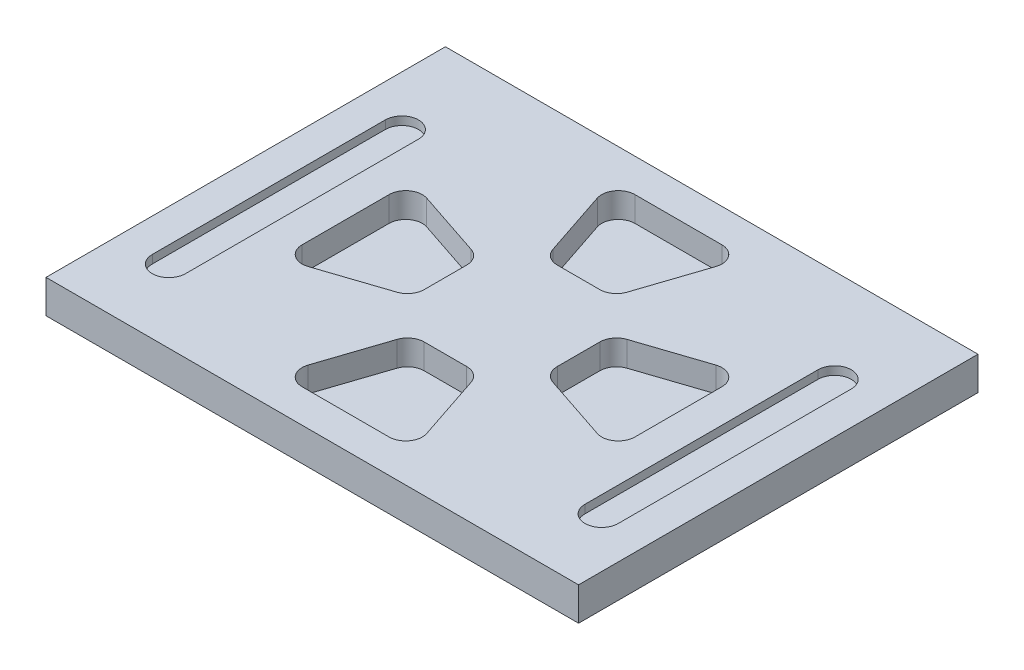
ISO-10303-21;
HEADER;
FILE_DESCRIPTION(('STEP AP214'),'2;1');
FILE_NAME('part.step','',(''),(''),'','','');
FILE_SCHEMA(('AUTOMOTIVE_DESIGN { 1 0 10303 214 1 1 1 1 }'));
ENDSEC;
DATA;
#1=APPLICATION_CONTEXT('core data for automotive mechanical design processes');
#2=APPLICATION_PROTOCOL_DEFINITION('international standard','automotive_design',2000,#1);
#3=PRODUCT_CONTEXT('',#1,'mechanical');
#4=PRODUCT('Part','Part','',(#3));
#5=PRODUCT_RELATED_PRODUCT_CATEGORY('part','',(#4));
#6=PRODUCT_DEFINITION_FORMATION('','',#4);
#7=PRODUCT_DEFINITION_CONTEXT('part definition',#1,'design');
#8=PRODUCT_DEFINITION('design','',#6,#7);
#9=PRODUCT_DEFINITION_SHAPE('','',#8);
#10=(LENGTH_UNIT() NAMED_UNIT(*) SI_UNIT(.MILLI.,.METRE.));
#11=(NAMED_UNIT(*) PLANE_ANGLE_UNIT() SI_UNIT($,.RADIAN.));
#12=(NAMED_UNIT(*) SI_UNIT($,.STERADIAN.) SOLID_ANGLE_UNIT());
#13=UNCERTAINTY_MEASURE_WITH_UNIT(LENGTH_MEASURE(1.E-05),#10,'distance_accuracy_value','');
#14=(GEOMETRIC_REPRESENTATION_CONTEXT(3) GLOBAL_UNCERTAINTY_ASSIGNED_CONTEXT((#13)) GLOBAL_UNIT_ASSIGNED_CONTEXT((#10,
#11,#12)) REPRESENTATION_CONTEXT('',''));
#15=CARTESIAN_POINT('',(0.,0.,0.));
#16=DIRECTION('',(0.,0.,1.));
#17=DIRECTION('',(1.,0.,0.));
#18=AXIS2_PLACEMENT_3D('',#15,#16,#17);
#19=CARTESIAN_POINT('',(203.2,-25.4,152.4));
#20=DIRECTION('',(1.,0.,0.));
#21=DIRECTION('',(0.,0.,-1.));
#22=AXIS2_PLACEMENT_3D('',#19,#20,#21);
#23=PLANE('',#22);
#24=DIRECTION('',(0.,0.,-1.));
#25=VECTOR('',#24,1.);
#26=CARTESIAN_POINT('',(203.2,0.,152.4));
#27=LINE('',#26,#25);
#28=CARTESIAN_POINT('',(203.2,0.,152.4));
#29=VERTEX_POINT('',#28);
#30=CARTESIAN_POINT('',(203.2,0.,-152.4));
#31=VERTEX_POINT('',#30);
#32=EDGE_CURVE('E677',#29,#31,#27,.T.);
#33=ORIENTED_EDGE('',*,*,#32,.F.);
#34=DIRECTION('',(0.,1.,0.));
#35=VECTOR('',#34,1.);
#36=CARTESIAN_POINT('',(203.2,-25.4,152.4));
#37=LINE('',#36,#35);
#38=CARTESIAN_POINT('',(203.2,-25.4,152.4));
#39=VERTEX_POINT('',#38);
#40=EDGE_CURVE('E12',#39,#29,#37,.T.);
#41=ORIENTED_EDGE('',*,*,#40,.F.);
#42=DIRECTION('',(0.,0.,-1.));
#43=VECTOR('',#42,1.);
#44=CARTESIAN_POINT('',(203.2,-25.4,152.4));
#45=LINE('',#44,#43);
#46=CARTESIAN_POINT('',(203.2,-25.4,-152.4));
#47=VERTEX_POINT('',#46);
#48=EDGE_CURVE('E1022',#39,#47,#45,.T.);
#49=ORIENTED_EDGE('',*,*,#48,.T.);
#50=DIRECTION('',(0.,1.,0.));
#51=VECTOR('',#50,1.);
#52=CARTESIAN_POINT('',(203.2,-25.4,-152.4));
#53=LINE('',#52,#51);
#54=EDGE_CURVE('E42',#47,#31,#53,.T.);
#55=ORIENTED_EDGE('',*,*,#54,.T.);
#56=EDGE_LOOP('',(#33,#41,#49,#55));
#57=FACE_BOUND('',#56,.T.);
#58=ADVANCED_FACE('F39',(#57),#23,.T.);
#59=CARTESIAN_POINT('',(-203.2,-25.4,152.4));
#60=DIRECTION('',(0.,0.,1.));
#61=DIRECTION('',(1.,0.,0.));
#62=AXIS2_PLACEMENT_3D('',#59,#60,#61);
#63=PLANE('',#62);
#64=DIRECTION('',(1.,0.,0.));
#65=VECTOR('',#64,1.);
#66=CARTESIAN_POINT('',(-203.2,0.,152.4));
#67=LINE('',#66,#65);
#68=CARTESIAN_POINT('',(-203.2,0.,152.4));
#69=VERTEX_POINT('',#68);
#70=EDGE_CURVE('E1026',#69,#29,#67,.T.);
#71=ORIENTED_EDGE('',*,*,#70,.F.);
#72=DIRECTION('',(0.,1.,0.));
#73=VECTOR('',#72,1.);
#74=CARTESIAN_POINT('',(-203.2,-25.4,152.4));
#75=LINE('',#74,#73);
#76=CARTESIAN_POINT('',(-203.2,-25.4,152.4));
#77=VERTEX_POINT('',#76);
#78=EDGE_CURVE('E47',#77,#69,#75,.T.);
#79=ORIENTED_EDGE('',*,*,#78,.F.);
#80=DIRECTION('',(1.,0.,0.));
#81=VECTOR('',#80,1.);
#82=CARTESIAN_POINT('',(-203.2,-25.4,152.4));
#83=LINE('',#82,#81);
#84=EDGE_CURVE('E1032',#77,#39,#83,.T.);
#85=ORIENTED_EDGE('',*,*,#84,.T.);
#86=ORIENTED_EDGE('',*,*,#40,.T.);
#87=EDGE_LOOP('',(#71,#79,#85,#86));
#88=FACE_BOUND('',#87,.T.);
#89=ADVANCED_FACE('F1059',(#88),#63,.T.);
#90=CARTESIAN_POINT('',(-203.2,-25.4,152.4));
#91=DIRECTION('',(-1.,0.,0.));
#92=DIRECTION('',(0.,0.,1.));
#93=AXIS2_PLACEMENT_3D('',#90,#91,#92);
#94=PLANE('',#93);
#95=DIRECTION('',(0.,0.,1.));
#96=VECTOR('',#95,1.);
#97=CARTESIAN_POINT('',(-203.2,0.,152.4));
#98=LINE('',#97,#96);
#99=CARTESIAN_POINT('',(-203.2,0.,-152.4));
#100=VERTEX_POINT('',#99);
#101=EDGE_CURVE('E1040',#100,#69,#98,.T.);
#102=ORIENTED_EDGE('',*,*,#101,.F.);
#103=DIRECTION('',(0.,1.,0.));
#104=VECTOR('',#103,1.);
#105=CARTESIAN_POINT('',(-203.2,-25.4,-152.4));
#106=LINE('',#105,#104);
#107=CARTESIAN_POINT('',(-203.2,-25.4,-152.4));
#108=VERTEX_POINT('',#107);
#109=EDGE_CURVE('E1046',#108,#100,#106,.T.);
#110=ORIENTED_EDGE('',*,*,#109,.F.);
#111=DIRECTION('',(0.,0.,1.));
#112=VECTOR('',#111,1.);
#113=CARTESIAN_POINT('',(-203.2,-25.4,152.4));
#114=LINE('',#113,#112);
#115=EDGE_CURVE('E1029',#108,#77,#114,.T.);
#116=ORIENTED_EDGE('',*,*,#115,.T.);
#117=ORIENTED_EDGE('',*,*,#78,.T.);
#118=EDGE_LOOP('',(#102,#110,#116,#117));
#119=FACE_BOUND('',#118,.T.);
#120=ADVANCED_FACE('F1065',(#119),#94,.T.);
#121=CARTESIAN_POINT('',(-203.2,-25.4,-152.4));
#122=DIRECTION('',(0.,0.,-1.));
#123=DIRECTION('',(-1.,0.,0.));
#124=AXIS2_PLACEMENT_3D('',#121,#122,#123);
#125=PLANE('',#124);
#126=DIRECTION('',(-1.,0.,0.));
#127=VECTOR('',#126,1.);
#128=CARTESIAN_POINT('',(-203.2,0.,-152.4));
#129=LINE('',#128,#127);
#130=EDGE_CURVE('E1037',#31,#100,#129,.T.);
#131=ORIENTED_EDGE('',*,*,#130,.F.);
#132=ORIENTED_EDGE('',*,*,#54,.F.);
#133=DIRECTION('',(-1.,0.,0.));
#134=VECTOR('',#133,1.);
#135=CARTESIAN_POINT('',(-203.2,-25.4,-152.4));
#136=LINE('',#135,#134);
#137=EDGE_CURVE('E1025',#47,#108,#136,.T.);
#138=ORIENTED_EDGE('',*,*,#137,.T.);
#139=ORIENTED_EDGE('',*,*,#109,.T.);
#140=EDGE_LOOP('',(#131,#132,#138,#139));
#141=FACE_BOUND('',#140,.T.);
#142=ADVANCED_FACE('F1054',(#141),#125,.T.);
#143=CARTESIAN_POINT('',(0.,-25.4,0.));
#144=DIRECTION('',(0.,-1.,0.));
#145=DIRECTION('',(0.,0.,-1.));
#146=AXIS2_PLACEMENT_3D('',#143,#144,#145);
#147=PLANE('',#146);
#148=CARTESIAN_POINT('',(165.1,-25.4,88.9));
#149=DIRECTION('',(0.,-1.,0.));
#150=DIRECTION('',(0.,0.,-1.));
#151=AXIS2_PLACEMENT_3D('',#148,#149,#150);
#152=CIRCLE('',#151,12.7);
#153=CARTESIAN_POINT('',(177.8,-25.4,88.9));
#154=VERTEX_POINT('',#153);
#155=CARTESIAN_POINT('',(152.4,-25.4,88.9));
#156=VERTEX_POINT('',#155);
#157=EDGE_CURVE('E55',#154,#156,#152,.T.);
#158=ORIENTED_EDGE('',*,*,#157,.F.);
#159=DIRECTION('',(0.,0.,1.));
#160=VECTOR('',#159,1.);
#161=CARTESIAN_POINT('',(177.8,-25.4,88.9));
#162=LINE('',#161,#160);
#163=CARTESIAN_POINT('',(177.8,-25.4,-88.9));
#164=VERTEX_POINT('',#163);
#165=EDGE_CURVE('E388',#164,#154,#162,.T.);
#166=ORIENTED_EDGE('',*,*,#165,.F.);
#167=CARTESIAN_POINT('',(165.1,-25.4,-88.9));
#168=DIRECTION('',(0.,-1.,0.));
#169=DIRECTION('',(0.,0.,-1.));
#170=AXIS2_PLACEMENT_3D('',#167,#168,#169);
#171=CIRCLE('',#170,12.7);
#172=CARTESIAN_POINT('',(152.4,-25.4,-88.9));
#173=VERTEX_POINT('',#172);
#174=EDGE_CURVE('E391',#173,#164,#171,.T.);
#175=ORIENTED_EDGE('',*,*,#174,.F.);
#176=DIRECTION('',(0.,0.,-1.));
#177=VECTOR('',#176,1.);
#178=CARTESIAN_POINT('',(152.4,-25.4,88.9));
#179=LINE('',#178,#177);
#180=EDGE_CURVE('E409',#156,#173,#179,.T.);
#181=ORIENTED_EDGE('',*,*,#180,.F.);
#182=EDGE_LOOP('',(#158,#166,#175,#181));
#183=FACE_BOUND('',#182,.T.);
#184=CARTESIAN_POINT('',(-165.1,-25.4,88.8999999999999));
#185=DIRECTION('',(0.,-1.,0.));
#186=DIRECTION('',(0.,0.,1.));
#187=AXIS2_PLACEMENT_3D('',#184,#185,#186);
#188=CIRCLE('',#187,12.7);
#189=CARTESIAN_POINT('',(-152.4,-25.4,88.8999999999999));
#190=VERTEX_POINT('',#189);
#191=CARTESIAN_POINT('',(-177.8,-25.4,88.8999999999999));
#192=VERTEX_POINT('',#191);
#193=EDGE_CURVE('E63',#190,#192,#188,.T.);
#194=ORIENTED_EDGE('',*,*,#193,.F.);
#195=DIRECTION('',(0.,0.,1.));
#196=VECTOR('',#195,1.);
#197=CARTESIAN_POINT('',(-152.4,-25.4,88.8999999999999));
#198=LINE('',#197,#196);
#199=CARTESIAN_POINT('',(-152.4,-25.4,-88.9));
#200=VERTEX_POINT('',#199);
#201=EDGE_CURVE('E441',#200,#190,#198,.T.);
#202=ORIENTED_EDGE('',*,*,#201,.F.);
#203=CARTESIAN_POINT('',(-165.1,-25.4,-88.9));
#204=DIRECTION('',(0.,-1.,0.));
#205=DIRECTION('',(0.,0.,1.));
#206=AXIS2_PLACEMENT_3D('',#203,#204,#205);
#207=CIRCLE('',#206,12.7);
#208=CARTESIAN_POINT('',(-177.8,-25.4,-88.9));
#209=VERTEX_POINT('',#208);
#210=EDGE_CURVE('E467',#209,#200,#207,.T.);
#211=ORIENTED_EDGE('',*,*,#210,.F.);
#212=DIRECTION('',(0.,0.,-1.));
#213=VECTOR('',#212,1.);
#214=CARTESIAN_POINT('',(-177.8,-25.4,88.8999999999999));
#215=LINE('',#214,#213);
#216=EDGE_CURVE('E459',#192,#209,#215,.T.);
#217=ORIENTED_EDGE('',*,*,#216,.F.);
#218=EDGE_LOOP('',(#194,#202,#211,#217));
#219=FACE_BOUND('',#218,.T.);
#220=ORIENTED_EDGE('',*,*,#48,.F.);
#221=ORIENTED_EDGE('',*,*,#84,.F.);
#222=ORIENTED_EDGE('',*,*,#115,.F.);
#223=ORIENTED_EDGE('',*,*,#137,.F.);
#224=EDGE_LOOP('',(#220,#221,#222,#223));
#225=FACE_BOUND('',#224,.T.);
#226=ADVANCED_FACE('F1062',(#183,#219,#225),#147,.T.);
#227=CARTESIAN_POINT('',(0.,0.,0.));
#228=DIRECTION('',(0.,-1.,0.));
#229=DIRECTION('',(0.,0.,-1.));
#230=AXIS2_PLACEMENT_3D('',#227,#228,#229);
#231=PLANE('',#230);
#232=DIRECTION('',(0.,0.,-1.));
#233=VECTOR('',#232,1.);
#234=CARTESIAN_POINT('',(-152.4,0.,96.7082805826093));
#235=LINE('',#234,#233);
#236=CARTESIAN_POINT('',(-152.4,0.,96.7082805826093));
#237=VERTEX_POINT('',#236);
#238=CARTESIAN_POINT('',(-152.4,0.,-81.0917194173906));
#239=VERTEX_POINT('',#238);
#240=EDGE_CURVE('E511',#237,#239,#235,.T.);
#241=ORIENTED_EDGE('',*,*,#240,.F.);
#242=CARTESIAN_POINT('',(-165.1,0.,96.7082805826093));
#243=DIRECTION('',(0.,1.,0.));
#244=DIRECTION('',(0.,0.,1.));
#245=AXIS2_PLACEMENT_3D('',#242,#243,#244);
#246=CIRCLE('',#245,12.7);
#247=CARTESIAN_POINT('',(-177.8,0.,96.7082805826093));
#248=VERTEX_POINT('',#247);
#249=EDGE_CURVE('E508',#248,#237,#246,.T.);
#250=ORIENTED_EDGE('',*,*,#249,.F.);
#251=DIRECTION('',(0.,0.,1.));
#252=VECTOR('',#251,1.);
#253=CARTESIAN_POINT('',(-177.8,0.,96.7082805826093));
#254=LINE('',#253,#252);
#255=CARTESIAN_POINT('',(-177.8,0.,-81.0917194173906));
#256=VERTEX_POINT('',#255);
#257=EDGE_CURVE('E492',#256,#248,#254,.T.);
#258=ORIENTED_EDGE('',*,*,#257,.F.);
#259=CARTESIAN_POINT('',(-165.1,0.,-81.0917194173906));
#260=DIRECTION('',(0.,1.,0.));
#261=DIRECTION('',(0.,0.,1.));
#262=AXIS2_PLACEMENT_3D('',#259,#260,#261);
#263=CIRCLE('',#262,12.7);
#264=EDGE_CURVE('E520',#239,#256,#263,.T.);
#265=ORIENTED_EDGE('',*,*,#264,.F.);
#266=EDGE_LOOP('',(#241,#250,#258,#265));
#267=FACE_BOUND('',#266,.T.);
#268=DIRECTION('',(0.,0.,-1.));
#269=VECTOR('',#268,1.);
#270=CARTESIAN_POINT('',(177.8,0.,96.7082805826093));
#271=LINE('',#270,#269);
#272=CARTESIAN_POINT('',(177.8,0.,96.7082805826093));
#273=VERTEX_POINT('',#272);
#274=CARTESIAN_POINT('',(177.8,0.,-81.0917194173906));
#275=VERTEX_POINT('',#274);
#276=EDGE_CURVE('E566',#273,#275,#271,.T.);
#277=ORIENTED_EDGE('',*,*,#276,.F.);
#278=CARTESIAN_POINT('',(165.1,0.,96.7082805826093));
#279=DIRECTION('',(0.,1.,0.));
#280=DIRECTION('',(0.,0.,-1.));
#281=AXIS2_PLACEMENT_3D('',#278,#279,#280);
#282=CIRCLE('',#281,12.7);
#283=CARTESIAN_POINT('',(152.4,0.,96.7082805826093));
#284=VERTEX_POINT('',#283);
#285=EDGE_CURVE('E425',#284,#273,#282,.T.);
#286=ORIENTED_EDGE('',*,*,#285,.F.);
#287=DIRECTION('',(0.,0.,1.));
#288=VECTOR('',#287,1.);
#289=CARTESIAN_POINT('',(152.4,0.,96.7082805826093));
#290=LINE('',#289,#288);
#291=CARTESIAN_POINT('',(152.4,0.,-81.0917194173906));
#292=VERTEX_POINT('',#291);
#293=EDGE_CURVE('E548',#292,#284,#290,.T.);
#294=ORIENTED_EDGE('',*,*,#293,.F.);
#295=CARTESIAN_POINT('',(165.1,0.,-81.0917194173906));
#296=DIRECTION('',(0.,1.,0.));
#297=DIRECTION('',(0.,0.,-1.));
#298=AXIS2_PLACEMENT_3D('',#295,#296,#297);
#299=CIRCLE('',#298,12.7);
#300=EDGE_CURVE('E574',#275,#292,#299,.T.);
#301=ORIENTED_EDGE('',*,*,#300,.F.);
#302=EDGE_LOOP('',(#277,#286,#294,#301));
#303=FACE_BOUND('',#302,.T.);
#304=DIRECTION('',(-0.948683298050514,0.,-0.316227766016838));
#305=VECTOR('',#304,1.);
#306=CARTESIAN_POINT('',(-59.4839073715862,0.,-28.2946357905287));
#307=LINE('',#306,#305);
#308=CARTESIAN_POINT('',(-59.4839073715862,0.,-28.2946357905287));
#309=VERTEX_POINT('',#308);
#310=CARTESIAN_POINT('',(-110.283907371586,0.,-45.2279691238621));
#311=VERTEX_POINT('',#310);
#312=EDGE_CURVE('E642',#309,#311,#307,.T.);
#313=ORIENTED_EDGE('',*,*,#312,.F.);
#314=CARTESIAN_POINT('',(-63.5,0.,-16.2463579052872));
#315=DIRECTION('',(0.,1.,0.));
#316=DIRECTION('',(0.,0.,1.));
#317=AXIS2_PLACEMENT_3D('',#314,#315,#316);
#318=CIRCLE('',#317,12.7);
#319=CARTESIAN_POINT('',(-50.8,0.,-16.2463579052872));
#320=VERTEX_POINT('',#319);
#321=EDGE_CURVE('E639',#320,#309,#318,.T.);
#322=ORIENTED_EDGE('',*,*,#321,.F.);
#323=DIRECTION('',(0.,0.,-1.));
#324=VECTOR('',#323,1.);
#325=CARTESIAN_POINT('',(-50.8,0.,16.2463579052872));
#326=LINE('',#325,#324);
#327=CARTESIAN_POINT('',(-50.8,0.,16.2463579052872));
#328=VERTEX_POINT('',#327);
#329=EDGE_CURVE('E600',#328,#320,#326,.T.);
#330=ORIENTED_EDGE('',*,*,#329,.F.);
#331=CARTESIAN_POINT('',(-63.5,0.,16.2463579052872));
#332=DIRECTION('',(0.,1.,0.));
#333=DIRECTION('',(0.,0.,1.));
#334=AXIS2_PLACEMENT_3D('',#331,#332,#333);
#335=CIRCLE('',#334,12.7);
#336=CARTESIAN_POINT('',(-59.4839073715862,0.,28.2946357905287));
#337=VERTEX_POINT('',#336);
#338=EDGE_CURVE('E669',#337,#328,#335,.T.);
#339=ORIENTED_EDGE('',*,*,#338,.F.);
#340=DIRECTION('',(0.948683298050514,0.,-0.316227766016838));
#341=VECTOR('',#340,1.);
#342=CARTESIAN_POINT('',(-110.283907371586,0.,45.2279691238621));
#343=LINE('',#342,#341);
#344=CARTESIAN_POINT('',(-110.283907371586,0.,45.2279691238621));
#345=VERTEX_POINT('',#344);
#346=EDGE_CURVE('E665',#345,#337,#343,.T.);
#347=ORIENTED_EDGE('',*,*,#346,.F.);
#348=CARTESIAN_POINT('',(-114.3,0.,33.1796912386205));
#349=DIRECTION('',(0.,1.,0.));
#350=DIRECTION('',(0.,0.,1.));
#351=AXIS2_PLACEMENT_3D('',#348,#349,#350);
#352=CIRCLE('',#351,12.7);
#353=CARTESIAN_POINT('',(-127.,0.,33.1796912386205));
#354=VERTEX_POINT('',#353);
#355=EDGE_CURVE('E661',#354,#345,#352,.T.);
#356=ORIENTED_EDGE('',*,*,#355,.F.);
#357=DIRECTION('',(0.,0.,1.));
#358=VECTOR('',#357,1.);
#359=CARTESIAN_POINT('',(-127.,0.,-33.1796912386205));
#360=LINE('',#359,#358);
#361=CARTESIAN_POINT('',(-127.,0.,-33.1796912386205));
#362=VERTEX_POINT('',#361);
#363=EDGE_CURVE('E657',#362,#354,#360,.T.);
#364=ORIENTED_EDGE('',*,*,#363,.F.);
#365=CARTESIAN_POINT('',(-114.3,0.,-33.1796912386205));
#366=DIRECTION('',(0.,1.,0.));
#367=DIRECTION('',(0.,0.,-1.));
#368=AXIS2_PLACEMENT_3D('',#365,#366,#367);
#369=CIRCLE('',#368,12.7);
#370=EDGE_CURVE('E654',#311,#362,#369,.T.);
#371=ORIENTED_EDGE('',*,*,#370,.F.);
#372=EDGE_LOOP('',(#313,#322,#330,#339,#347,#356,#364,#371));
#373=FACE_BOUND('',#372,.T.);
#374=DIRECTION('',(0.316227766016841,0.,-0.948683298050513));
#375=VECTOR('',#374,1.);
#376=CARTESIAN_POINT('',(28.2946357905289,0.,-59.4839073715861));
#377=LINE('',#376,#375);
#378=CARTESIAN_POINT('',(28.2946357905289,0.,-59.4839073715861));
#379=VERTEX_POINT('',#378);
#380=CARTESIAN_POINT('',(45.2279691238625,0.,-110.283907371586));
#381=VERTEX_POINT('',#380);
#382=EDGE_CURVE('E753',#379,#381,#377,.T.);
#383=ORIENTED_EDGE('',*,*,#382,.F.);
#384=CARTESIAN_POINT('',(16.2463579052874,0.,-63.5));
#385=DIRECTION('',(0.,1.,0.));
#386=DIRECTION('',(0.,0.,1.));
#387=AXIS2_PLACEMENT_3D('',#384,#385,#386);
#388=CIRCLE('',#387,12.7);
#389=CARTESIAN_POINT('',(16.2463579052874,0.,-50.7999999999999));
#390=VERTEX_POINT('',#389);
#391=EDGE_CURVE('E750',#390,#379,#388,.T.);
#392=ORIENTED_EDGE('',*,*,#391,.F.);
#393=DIRECTION('',(1.,0.,0.));
#394=VECTOR('',#393,1.);
#395=CARTESIAN_POINT('',(-16.246357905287,0.,-50.8000000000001));
#396=LINE('',#395,#394);
#397=CARTESIAN_POINT('',(-16.246357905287,0.,-50.8000000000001));
#398=VERTEX_POINT('',#397);
#399=EDGE_CURVE('E711',#398,#390,#396,.T.);
#400=ORIENTED_EDGE('',*,*,#399,.F.);
#401=CARTESIAN_POINT('',(-16.246357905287,0.,-63.5000000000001));
#402=DIRECTION('',(0.,1.,0.));
#403=DIRECTION('',(0.,0.,1.));
#404=AXIS2_PLACEMENT_3D('',#401,#402,#403);
#405=CIRCLE('',#404,12.7);
#406=CARTESIAN_POINT('',(-28.2946357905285,0.,-59.4839073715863));
#407=VERTEX_POINT('',#406);
#408=EDGE_CURVE('E777',#407,#398,#405,.T.);
#409=ORIENTED_EDGE('',*,*,#408,.F.);
#410=DIRECTION('',(0.316227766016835,0.,0.948683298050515));
#411=VECTOR('',#410,1.);
#412=CARTESIAN_POINT('',(-45.2279691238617,0.,-110.283907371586));
#413=LINE('',#412,#411);
#414=CARTESIAN_POINT('',(-45.2279691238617,0.,-110.283907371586));
#415=VERTEX_POINT('',#414);
#416=EDGE_CURVE('E773',#415,#407,#413,.T.);
#417=ORIENTED_EDGE('',*,*,#416,.F.);
#418=CARTESIAN_POINT('',(-33.1796912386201,0.,-114.3));
#419=DIRECTION('',(0.,1.,0.));
#420=DIRECTION('',(0.,0.,1.));
#421=AXIS2_PLACEMENT_3D('',#418,#419,#420);
#422=CIRCLE('',#421,12.7);
#423=CARTESIAN_POINT('',(-33.1796912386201,0.,-127.));
#424=VERTEX_POINT('',#423);
#425=EDGE_CURVE('E769',#424,#415,#422,.T.);
#426=ORIENTED_EDGE('',*,*,#425,.F.);
#427=DIRECTION('',(-1.,0.,0.));
#428=VECTOR('',#427,1.);
#429=CARTESIAN_POINT('',(33.179691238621,0.,-127.));
#430=LINE('',#429,#428);
#431=CARTESIAN_POINT('',(33.179691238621,0.,-127.));
#432=VERTEX_POINT('',#431);
#433=EDGE_CURVE('E765',#432,#424,#430,.T.);
#434=ORIENTED_EDGE('',*,*,#433,.F.);
#435=CARTESIAN_POINT('',(33.1796912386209,0.,-114.3));
#436=DIRECTION('',(0.,1.,0.));
#437=DIRECTION('',(0.,0.,-1.));
#438=AXIS2_PLACEMENT_3D('',#435,#436,#437);
#439=CIRCLE('',#438,12.7);
#440=EDGE_CURVE('E762',#381,#432,#439,.T.);
#441=ORIENTED_EDGE('',*,*,#440,.F.);
#442=EDGE_LOOP('',(#383,#392,#400,#409,#417,#426,#434,#441));
#443=FACE_BOUND('',#442,.T.);
#444=DIRECTION('',(0.948683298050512,0.,0.316227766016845));
#445=VECTOR('',#444,1.);
#446=CARTESIAN_POINT('',(59.483907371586,0.,28.2946357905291));
#447=LINE('',#446,#445);
#448=CARTESIAN_POINT('',(59.483907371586,0.,28.2946357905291));
#449=VERTEX_POINT('',#448);
#450=CARTESIAN_POINT('',(110.283907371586,0.,45.2279691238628));
#451=VERTEX_POINT('',#450);
#452=EDGE_CURVE('E861',#449,#451,#447,.T.);
#453=ORIENTED_EDGE('',*,*,#452,.F.);
#454=CARTESIAN_POINT('',(63.4999999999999,0.,16.2463579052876));
#455=DIRECTION('',(0.,1.,0.));
#456=DIRECTION('',(0.,0.,1.));
#457=AXIS2_PLACEMENT_3D('',#454,#455,#456);
#458=CIRCLE('',#457,12.7);
#459=CARTESIAN_POINT('',(50.7999999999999,0.,16.2463579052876));
#460=VERTEX_POINT('',#459);
#461=EDGE_CURVE('E858',#460,#449,#458,.T.);
#462=ORIENTED_EDGE('',*,*,#461,.F.);
#463=DIRECTION('',(0.,0.,1.));
#464=VECTOR('',#463,1.);
#465=CARTESIAN_POINT('',(50.8000000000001,0.,-16.2463579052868));
#466=LINE('',#465,#464);
#467=CARTESIAN_POINT('',(50.8000000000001,0.,-16.2463579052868));
#468=VERTEX_POINT('',#467);
#469=EDGE_CURVE('E819',#468,#460,#466,.T.);
#470=ORIENTED_EDGE('',*,*,#469,.F.);
#471=CARTESIAN_POINT('',(63.5000000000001,0.,-16.2463579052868));
#472=DIRECTION('',(0.,1.,0.));
#473=DIRECTION('',(0.,0.,1.));
#474=AXIS2_PLACEMENT_3D('',#471,#472,#473);
#475=CIRCLE('',#474,12.7);
#476=CARTESIAN_POINT('',(59.4839073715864,0.,-28.2946357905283));
#477=VERTEX_POINT('',#476);
#478=EDGE_CURVE('E885',#477,#468,#475,.T.);
#479=ORIENTED_EDGE('',*,*,#478,.F.);
#480=DIRECTION('',(-0.948683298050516,0.,0.316227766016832));
#481=VECTOR('',#480,1.);
#482=CARTESIAN_POINT('',(110.283907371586,0.,-45.2279691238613));
#483=LINE('',#482,#481);
#484=CARTESIAN_POINT('',(110.283907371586,0.,-45.2279691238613));
#485=VERTEX_POINT('',#484);
#486=EDGE_CURVE('E881',#485,#477,#483,.T.);
#487=ORIENTED_EDGE('',*,*,#486,.F.);
#488=CARTESIAN_POINT('',(114.3,0.,-33.1796912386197));
#489=DIRECTION('',(0.,1.,0.));
#490=DIRECTION('',(0.,0.,1.));
#491=AXIS2_PLACEMENT_3D('',#488,#489,#490);
#492=CIRCLE('',#491,12.7);
#493=CARTESIAN_POINT('',(127.,0.,-33.1796912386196));
#494=VERTEX_POINT('',#493);
#495=EDGE_CURVE('E877',#494,#485,#492,.T.);
#496=ORIENTED_EDGE('',*,*,#495,.F.);
#497=DIRECTION('',(0.,0.,-1.));
#498=VECTOR('',#497,1.);
#499=CARTESIAN_POINT('',(127.,0.,33.1796912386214));
#500=LINE('',#499,#498);
#501=CARTESIAN_POINT('',(127.,0.,33.1796912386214));
#502=VERTEX_POINT('',#501);
#503=EDGE_CURVE('E873',#502,#494,#500,.T.);
#504=ORIENTED_EDGE('',*,*,#503,.F.);
#505=CARTESIAN_POINT('',(114.3,0.,33.1796912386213));
#506=DIRECTION('',(0.,1.,0.));
#507=DIRECTION('',(0.,0.,-1.));
#508=AXIS2_PLACEMENT_3D('',#505,#506,#507);
#509=CIRCLE('',#508,12.7);
#510=EDGE_CURVE('E870',#451,#502,#509,.T.);
#511=ORIENTED_EDGE('',*,*,#510,.F.);
#512=EDGE_LOOP('',(#453,#462,#470,#479,#487,#496,#504,#511));
#513=FACE_BOUND('',#512,.T.);
#514=DIRECTION('',(-0.316227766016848,0.,0.94868329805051));
#515=VECTOR('',#514,1.);
#516=CARTESIAN_POINT('',(-28.2946357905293,0.,59.4839073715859));
#517=LINE('',#516,#515);
#518=CARTESIAN_POINT('',(-28.2946357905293,0.,59.4839073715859));
#519=VERTEX_POINT('',#518);
#520=CARTESIAN_POINT('',(-45.2279691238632,0.,110.283907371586));
#521=VERTEX_POINT('',#520);
#522=EDGE_CURVE('E964',#519,#521,#517,.T.);
#523=ORIENTED_EDGE('',*,*,#522,.F.);
#524=CARTESIAN_POINT('',(-16.2463579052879,0.,63.4999999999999));
#525=DIRECTION('',(0.,1.,0.));
#526=DIRECTION('',(0.,0.,1.));
#527=AXIS2_PLACEMENT_3D('',#524,#525,#526);
#528=CIRCLE('',#527,12.7);
#529=CARTESIAN_POINT('',(-16.2463579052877,0.,50.7999999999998));
#530=VERTEX_POINT('',#529);
#531=EDGE_CURVE('E529',#530,#519,#528,.T.);
#532=ORIENTED_EDGE('',*,*,#531,.F.);
#533=DIRECTION('',(-1.,0.,0.));
#534=VECTOR('',#533,1.);
#535=CARTESIAN_POINT('',(16.2463579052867,0.,50.8000000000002));
#536=LINE('',#535,#534);
#537=CARTESIAN_POINT('',(16.2463579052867,0.,50.8000000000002));
#538=VERTEX_POINT('',#537);
#539=EDGE_CURVE('E927',#538,#530,#536,.T.);
#540=ORIENTED_EDGE('',*,*,#539,.F.);
#541=CARTESIAN_POINT('',(16.2463579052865,0.,63.5000000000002));
#542=DIRECTION('',(0.,1.,0.));
#543=DIRECTION('',(0.,0.,1.));
#544=AXIS2_PLACEMENT_3D('',#541,#542,#543);
#545=CIRCLE('',#544,12.7);
#546=CARTESIAN_POINT('',(28.2946357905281,0.,59.4839073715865));
#547=VERTEX_POINT('',#546);
#548=EDGE_CURVE('E987',#547,#538,#545,.T.);
#549=ORIENTED_EDGE('',*,*,#548,.F.);
#550=DIRECTION('',(-0.316227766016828,0.,-0.948683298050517));
#551=VECTOR('',#550,1.);
#552=CARTESIAN_POINT('',(45.2279691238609,0.,110.283907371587));
#553=LINE('',#552,#551);
#554=CARTESIAN_POINT('',(45.2279691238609,0.,110.283907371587));
#555=VERTEX_POINT('',#554);
#556=EDGE_CURVE('E983',#555,#547,#553,.T.);
#557=ORIENTED_EDGE('',*,*,#556,.F.);
#558=CARTESIAN_POINT('',(33.1796912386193,0.,114.3));
#559=DIRECTION('',(0.,1.,0.));
#560=DIRECTION('',(0.,0.,1.));
#561=AXIS2_PLACEMENT_3D('',#558,#559,#560);
#562=CIRCLE('',#561,12.7);
#563=CARTESIAN_POINT('',(33.1796912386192,0.,127.));
#564=VERTEX_POINT('',#563);
#565=EDGE_CURVE('E979',#564,#555,#562,.T.);
#566=ORIENTED_EDGE('',*,*,#565,.F.);
#567=DIRECTION('',(1.,0.,0.));
#568=VECTOR('',#567,1.);
#569=CARTESIAN_POINT('',(-33.1796912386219,0.,127.));
#570=LINE('',#569,#568);
#571=CARTESIAN_POINT('',(-33.1796912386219,0.,127.));
#572=VERTEX_POINT('',#571);
#573=EDGE_CURVE('E975',#572,#564,#570,.T.);
#574=ORIENTED_EDGE('',*,*,#573,.F.);
#575=CARTESIAN_POINT('',(-33.1796912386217,0.,114.3));
#576=DIRECTION('',(0.,1.,0.));
#577=DIRECTION('',(0.,0.,-1.));
#578=AXIS2_PLACEMENT_3D('',#575,#576,#577);
#579=CIRCLE('',#578,12.7);
#580=EDGE_CURVE('E972',#521,#572,#579,.T.);
#581=ORIENTED_EDGE('',*,*,#580,.F.);
#582=EDGE_LOOP('',(#523,#532,#540,#549,#557,#566,#574,#581));
#583=FACE_BOUND('',#582,.T.);
#584=ORIENTED_EDGE('',*,*,#32,.T.);
#585=ORIENTED_EDGE('',*,*,#130,.T.);
#586=ORIENTED_EDGE('',*,*,#101,.T.);
#587=ORIENTED_EDGE('',*,*,#70,.T.);
#588=EDGE_LOOP('',(#584,#585,#586,#587));
#589=FACE_BOUND('',#588,.T.);
#590=ADVANCED_FACE('F1056',(#267,#303,#373,#443,#513,#583,#589),#231,.F.);
#591=CARTESIAN_POINT('',(-16.2463579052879,-19.05,63.4999999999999));
#592=DIRECTION('',(0.,1.,0.));
#593=DIRECTION('',(0.,0.,1.));
#594=AXIS2_PLACEMENT_3D('',#591,#592,#593);
#595=CYLINDRICAL_SURFACE('',#594,12.7);
#596=ORIENTED_EDGE('',*,*,#531,.T.);
#597=DIRECTION('',(0.,1.,0.));
#598=VECTOR('',#597,1.);
#599=CARTESIAN_POINT('',(-28.2946357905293,-19.05,59.4839073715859));
#600=LINE('',#599,#598);
#601=CARTESIAN_POINT('',(-28.2946357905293,-19.05,59.4839073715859));
#602=VERTEX_POINT('',#601);
#603=EDGE_CURVE('E961',#602,#519,#600,.T.);
#604=ORIENTED_EDGE('',*,*,#603,.F.);
#605=CARTESIAN_POINT('',(-16.2463579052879,-19.05,63.4999999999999));
#606=DIRECTION('',(0.,1.,0.));
#607=DIRECTION('',(0.,0.,1.));
#608=AXIS2_PLACEMENT_3D('',#605,#606,#607);
#609=CIRCLE('',#608,12.7);
#610=CARTESIAN_POINT('',(-16.2463579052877,-19.05,50.7999999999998));
#611=VERTEX_POINT('',#610);
#612=EDGE_CURVE('E922',#611,#602,#609,.T.);
#613=ORIENTED_EDGE('',*,*,#612,.F.);
#614=DIRECTION('',(0.,1.,0.));
#615=VECTOR('',#614,1.);
#616=CARTESIAN_POINT('',(-16.2463579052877,-19.05,50.7999999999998));
#617=LINE('',#616,#615);
#618=EDGE_CURVE('E862',#611,#530,#617,.T.);
#619=ORIENTED_EDGE('',*,*,#618,.T.);
#620=EDGE_LOOP('',(#596,#604,#613,#619));
#621=FACE_BOUND('',#620,.T.);
#622=ADVANCED_FACE('F1097',(#621),#595,.F.);
#623=CARTESIAN_POINT('',(16.2463579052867,-19.05,50.8000000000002));
#624=DIRECTION('',(0.,0.,-1.));
#625=DIRECTION('',(-1.,0.,0.));
#626=AXIS2_PLACEMENT_3D('',#623,#624,#625);
#627=PLANE('',#626);
#628=ORIENTED_EDGE('',*,*,#539,.T.);
#629=ORIENTED_EDGE('',*,*,#618,.F.);
#630=DIRECTION('',(-1.,0.,0.));
#631=VECTOR('',#630,1.);
#632=CARTESIAN_POINT('',(16.2463579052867,-19.05,50.8000000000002));
#633=LINE('',#632,#631);
#634=CARTESIAN_POINT('',(16.2463579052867,-19.05,50.8000000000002));
#635=VERTEX_POINT('',#634);
#636=EDGE_CURVE('E957',#635,#611,#633,.T.);
#637=ORIENTED_EDGE('',*,*,#636,.F.);
#638=DIRECTION('',(0.,1.,0.));
#639=VECTOR('',#638,1.);
#640=CARTESIAN_POINT('',(16.2463579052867,-19.05,50.8000000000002));
#641=LINE('',#640,#639);
#642=EDGE_CURVE('E995',#635,#538,#641,.T.);
#643=ORIENTED_EDGE('',*,*,#642,.T.);
#644=EDGE_LOOP('',(#628,#629,#637,#643));
#645=FACE_BOUND('',#644,.T.);
#646=ADVANCED_FACE('F1103',(#645),#627,.F.);
#647=CARTESIAN_POINT('',(16.2463579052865,-19.05,63.5000000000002));
#648=DIRECTION('',(0.,1.,0.));
#649=DIRECTION('',(0.,0.,1.));
#650=AXIS2_PLACEMENT_3D('',#647,#648,#649);
#651=CYLINDRICAL_SURFACE('',#650,12.7);
#652=ORIENTED_EDGE('',*,*,#548,.T.);
#653=ORIENTED_EDGE('',*,*,#642,.F.);
#654=CARTESIAN_POINT('',(16.2463579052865,-19.05,63.5000000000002));
#655=DIRECTION('',(0.,1.,0.));
#656=DIRECTION('',(0.,0.,1.));
#657=AXIS2_PLACEMENT_3D('',#654,#655,#656);
#658=CIRCLE('',#657,12.7);
#659=CARTESIAN_POINT('',(28.2946357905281,-19.05,59.4839073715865));
#660=VERTEX_POINT('',#659);
#661=EDGE_CURVE('E954',#660,#635,#658,.T.);
#662=ORIENTED_EDGE('',*,*,#661,.F.);
#663=DIRECTION('',(0.,1.,0.));
#664=VECTOR('',#663,1.);
#665=CARTESIAN_POINT('',(28.2946357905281,-19.05,59.4839073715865));
#666=LINE('',#665,#664);
#667=EDGE_CURVE('E1003',#660,#547,#666,.T.);
#668=ORIENTED_EDGE('',*,*,#667,.T.);
#669=EDGE_LOOP('',(#652,#653,#662,#668));
#670=FACE_BOUND('',#669,.T.);
#671=ADVANCED_FACE('F1116',(#670),#651,.F.);
#672=CARTESIAN_POINT('',(45.2279691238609,-19.05,110.283907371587));
#673=DIRECTION('',(0.948683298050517,0.,-0.316227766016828));
#674=DIRECTION('',(-0.316227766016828,0.,-0.948683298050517));
#675=AXIS2_PLACEMENT_3D('',#672,#673,#674);
#676=PLANE('',#675);
#677=ORIENTED_EDGE('',*,*,#556,.T.);
#678=ORIENTED_EDGE('',*,*,#667,.F.);
#679=DIRECTION('',(-0.316227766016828,0.,-0.948683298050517));
#680=VECTOR('',#679,1.);
#681=CARTESIAN_POINT('',(45.2279691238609,-19.05,110.283907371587));
#682=LINE('',#681,#680);
#683=CARTESIAN_POINT('',(45.2279691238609,-19.05,110.283907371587));
#684=VERTEX_POINT('',#683);
#685=EDGE_CURVE('E950',#684,#660,#682,.T.);
#686=ORIENTED_EDGE('',*,*,#685,.F.);
#687=DIRECTION('',(0.,1.,0.));
#688=VECTOR('',#687,1.);
#689=CARTESIAN_POINT('',(45.2279691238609,-19.05,110.283907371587));
#690=LINE('',#689,#688);
#691=EDGE_CURVE('E1005',#684,#555,#690,.T.);
#692=ORIENTED_EDGE('',*,*,#691,.T.);
#693=EDGE_LOOP('',(#677,#678,#686,#692));
#694=FACE_BOUND('',#693,.T.);
#695=ADVANCED_FACE('F1127',(#694),#676,.F.);
#696=CARTESIAN_POINT('',(33.1796912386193,-19.05,114.3));
#697=DIRECTION('',(0.,1.,0.));
#698=DIRECTION('',(0.,0.,1.));
#699=AXIS2_PLACEMENT_3D('',#696,#697,#698);
#700=CYLINDRICAL_SURFACE('',#699,12.7);
#701=ORIENTED_EDGE('',*,*,#565,.T.);
#702=ORIENTED_EDGE('',*,*,#691,.F.);
#703=CARTESIAN_POINT('',(33.1796912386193,-19.05,114.3));
#704=DIRECTION('',(0.,1.,0.));
#705=DIRECTION('',(0.,0.,1.));
#706=AXIS2_PLACEMENT_3D('',#703,#704,#705);
#707=CIRCLE('',#706,12.7);
#708=CARTESIAN_POINT('',(33.1796912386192,-19.05,127.));
#709=VERTEX_POINT('',#708);
#710=EDGE_CURVE('E946',#709,#684,#707,.T.);
#711=ORIENTED_EDGE('',*,*,#710,.F.);
#712=DIRECTION('',(0.,1.,0.));
#713=VECTOR('',#712,1.);
#714=CARTESIAN_POINT('',(33.1796912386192,-19.05,127.));
#715=LINE('',#714,#713);
#716=EDGE_CURVE('E1008',#709,#564,#715,.T.);
#717=ORIENTED_EDGE('',*,*,#716,.T.);
#718=EDGE_LOOP('',(#701,#702,#711,#717));
#719=FACE_BOUND('',#718,.T.);
#720=ADVANCED_FACE('F1138',(#719),#700,.F.);
#721=CARTESIAN_POINT('',(-33.1796912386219,-19.05,127.));
#722=DIRECTION('',(0.,0.,1.));
#723=DIRECTION('',(1.,0.,0.));
#724=AXIS2_PLACEMENT_3D('',#721,#722,#723);
#725=PLANE('',#724);
#726=ORIENTED_EDGE('',*,*,#573,.T.);
#727=ORIENTED_EDGE('',*,*,#716,.F.);
#728=DIRECTION('',(1.,0.,0.));
#729=VECTOR('',#728,1.);
#730=CARTESIAN_POINT('',(-33.1796912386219,-19.05,127.));
#731=LINE('',#730,#729);
#732=CARTESIAN_POINT('',(-33.1796912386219,-19.05,127.));
#733=VERTEX_POINT('',#732);
#734=EDGE_CURVE('E942',#733,#709,#731,.T.);
#735=ORIENTED_EDGE('',*,*,#734,.F.);
#736=DIRECTION('',(0.,1.,0.));
#737=VECTOR('',#736,1.);
#738=CARTESIAN_POINT('',(-33.1796912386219,-19.05,127.));
#739=LINE('',#738,#737);
#740=EDGE_CURVE('E1011',#733,#572,#739,.T.);
#741=ORIENTED_EDGE('',*,*,#740,.T.);
#742=EDGE_LOOP('',(#726,#727,#735,#741));
#743=FACE_BOUND('',#742,.T.);
#744=ADVANCED_FACE('F1149',(#743),#725,.F.);
#745=CARTESIAN_POINT('',(-33.1796912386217,-19.05,114.3));
#746=DIRECTION('',(0.,1.,0.));
#747=DIRECTION('',(0.,0.,1.));
#748=AXIS2_PLACEMENT_3D('',#745,#746,#747);
#749=CYLINDRICAL_SURFACE('',#748,12.7);
#750=ORIENTED_EDGE('',*,*,#580,.T.);
#751=ORIENTED_EDGE('',*,*,#740,.F.);
#752=CARTESIAN_POINT('',(-33.1796912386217,-19.05,114.3));
#753=DIRECTION('',(0.,1.,0.));
#754=DIRECTION('',(0.,0.,-1.));
#755=AXIS2_PLACEMENT_3D('',#752,#753,#754);
#756=CIRCLE('',#755,12.7);
#757=CARTESIAN_POINT('',(-45.2279691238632,-19.05,110.283907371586));
#758=VERTEX_POINT('',#757);
#759=EDGE_CURVE('E939',#758,#733,#756,.T.);
#760=ORIENTED_EDGE('',*,*,#759,.F.);
#761=DIRECTION('',(0.,1.,0.));
#762=VECTOR('',#761,1.);
#763=CARTESIAN_POINT('',(-45.2279691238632,-19.05,110.283907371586));
#764=LINE('',#763,#762);
#765=EDGE_CURVE('E1020',#758,#521,#764,.T.);
#766=ORIENTED_EDGE('',*,*,#765,.T.);
#767=EDGE_LOOP('',(#750,#751,#760,#766));
#768=FACE_BOUND('',#767,.T.);
#769=ADVANCED_FACE('F1160',(#768),#749,.F.);
#770=CARTESIAN_POINT('',(-28.2946357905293,-19.05,59.4839073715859));
#771=DIRECTION('',(-0.94868329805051,0.,-0.316227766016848));
#772=DIRECTION('',(-0.316227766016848,0.,0.948683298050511));
#773=AXIS2_PLACEMENT_3D('',#770,#771,#772);
#774=PLANE('',#773);
#775=ORIENTED_EDGE('',*,*,#522,.T.);
#776=ORIENTED_EDGE('',*,*,#765,.F.);
#777=DIRECTION('',(-0.316227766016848,0.,0.94868329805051));
#778=VECTOR('',#777,1.);
#779=CARTESIAN_POINT('',(-28.2946357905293,-19.05,59.4839073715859));
#780=LINE('',#779,#778);
#781=EDGE_CURVE('E926',#602,#758,#780,.T.);
#782=ORIENTED_EDGE('',*,*,#781,.F.);
#783=ORIENTED_EDGE('',*,*,#603,.T.);
#784=EDGE_LOOP('',(#775,#776,#782,#783));
#785=FACE_BOUND('',#784,.T.);
#786=ADVANCED_FACE('F1171',(#785),#774,.F.);
#787=CARTESIAN_POINT('',(-16.2463579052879,-19.05,63.4999999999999));
#788=DIRECTION('',(0.,1.,0.));
#789=DIRECTION('',(0.,0.,1.));
#790=AXIS2_PLACEMENT_3D('',#787,#788,#789);
#791=PLANE('',#790);
#792=ORIENTED_EDGE('',*,*,#612,.T.);
#793=ORIENTED_EDGE('',*,*,#781,.T.);
#794=ORIENTED_EDGE('',*,*,#759,.T.);
#795=ORIENTED_EDGE('',*,*,#734,.T.);
#796=ORIENTED_EDGE('',*,*,#710,.T.);
#797=ORIENTED_EDGE('',*,*,#685,.T.);
#798=ORIENTED_EDGE('',*,*,#661,.T.);
#799=ORIENTED_EDGE('',*,*,#636,.T.);
#800=EDGE_LOOP('',(#792,#793,#794,#795,#796,#797,#798,#799));
#801=FACE_BOUND('',#800,.T.);
#802=ADVANCED_FACE('F1182',(#801),#791,.T.);
#803=CARTESIAN_POINT('',(63.4999999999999,-19.05,16.2463579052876));
#804=DIRECTION('',(0.,1.,0.));
#805=DIRECTION('',(0.,0.,1.));
#806=AXIS2_PLACEMENT_3D('',#803,#804,#805);
#807=CYLINDRICAL_SURFACE('',#806,12.7);
#808=ORIENTED_EDGE('',*,*,#461,.T.);
#809=DIRECTION('',(0.,1.,0.));
#810=VECTOR('',#809,1.);
#811=CARTESIAN_POINT('',(59.483907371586,-19.05,28.2946357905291));
#812=LINE('',#811,#810);
#813=CARTESIAN_POINT('',(59.483907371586,-19.05,28.2946357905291));
#814=VERTEX_POINT('',#813);
#815=EDGE_CURVE('E857',#814,#449,#812,.T.);
#816=ORIENTED_EDGE('',*,*,#815,.F.);
#817=CARTESIAN_POINT('',(63.4999999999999,-19.05,16.2463579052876));
#818=DIRECTION('',(0.,1.,0.));
#819=DIRECTION('',(0.,0.,1.));
#820=AXIS2_PLACEMENT_3D('',#817,#818,#819);
#821=CIRCLE('',#820,12.7);
#822=CARTESIAN_POINT('',(50.7999999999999,-19.05,16.2463579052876));
#823=VERTEX_POINT('',#822);
#824=EDGE_CURVE('E814',#823,#814,#821,.T.);
#825=ORIENTED_EDGE('',*,*,#824,.F.);
#826=DIRECTION('',(0.,1.,0.));
#827=VECTOR('',#826,1.);
#828=CARTESIAN_POINT('',(50.7999999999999,-19.05,16.2463579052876));
#829=LINE('',#828,#827);
#830=EDGE_CURVE('E754',#823,#460,#829,.T.);
#831=ORIENTED_EDGE('',*,*,#830,.T.);
#832=EDGE_LOOP('',(#808,#816,#825,#831));
#833=FACE_BOUND('',#832,.T.);
#834=ADVANCED_FACE('F1193',(#833),#807,.F.);
#835=CARTESIAN_POINT('',(50.8000000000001,-19.05,-16.2463579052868));
#836=DIRECTION('',(-1.,0.,0.));
#837=DIRECTION('',(0.,0.,1.));
#838=AXIS2_PLACEMENT_3D('',#835,#836,#837);
#839=PLANE('',#838);
#840=ORIENTED_EDGE('',*,*,#469,.T.);
#841=ORIENTED_EDGE('',*,*,#830,.F.);
#842=DIRECTION('',(0.,0.,1.));
#843=VECTOR('',#842,1.);
#844=CARTESIAN_POINT('',(50.8000000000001,-19.05,-16.2463579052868));
#845=LINE('',#844,#843);
#846=CARTESIAN_POINT('',(50.8000000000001,-19.05,-16.2463579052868));
#847=VERTEX_POINT('',#846);
#848=EDGE_CURVE('E853',#847,#823,#845,.T.);
#849=ORIENTED_EDGE('',*,*,#848,.F.);
#850=DIRECTION('',(0.,1.,0.));
#851=VECTOR('',#850,1.);
#852=CARTESIAN_POINT('',(50.8000000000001,-19.05,-16.2463579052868));
#853=LINE('',#852,#851);
#854=EDGE_CURVE('E893',#847,#468,#853,.T.);
#855=ORIENTED_EDGE('',*,*,#854,.T.);
#856=EDGE_LOOP('',(#840,#841,#849,#855));
#857=FACE_BOUND('',#856,.T.);
#858=ADVANCED_FACE('F1205',(#857),#839,.F.);
#859=CARTESIAN_POINT('',(63.5000000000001,-19.05,-16.2463579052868));
#860=DIRECTION('',(0.,1.,0.));
#861=DIRECTION('',(0.,0.,1.));
#862=AXIS2_PLACEMENT_3D('',#859,#860,#861);
#863=CYLINDRICAL_SURFACE('',#862,12.7);
#864=ORIENTED_EDGE('',*,*,#478,.T.);
#865=ORIENTED_EDGE('',*,*,#854,.F.);
#866=CARTESIAN_POINT('',(63.5000000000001,-19.05,-16.2463579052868));
#867=DIRECTION('',(0.,1.,0.));
#868=DIRECTION('',(0.,0.,1.));
#869=AXIS2_PLACEMENT_3D('',#866,#867,#868);
#870=CIRCLE('',#869,12.7);
#871=CARTESIAN_POINT('',(59.4839073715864,-19.05,-28.2946357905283));
#872=VERTEX_POINT('',#871);
#873=EDGE_CURVE('E850',#872,#847,#870,.T.);
#874=ORIENTED_EDGE('',*,*,#873,.F.);
#875=DIRECTION('',(0.,1.,0.));
#876=VECTOR('',#875,1.);
#877=CARTESIAN_POINT('',(59.4839073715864,-19.05,-28.2946357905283));
#878=LINE('',#877,#876);
#879=EDGE_CURVE('E901',#872,#477,#878,.T.);
#880=ORIENTED_EDGE('',*,*,#879,.T.);
#881=EDGE_LOOP('',(#864,#865,#874,#880));
#882=FACE_BOUND('',#881,.T.);
#883=ADVANCED_FACE('F1217',(#882),#863,.F.);
#884=CARTESIAN_POINT('',(110.283907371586,-19.05,-45.2279691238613));
#885=DIRECTION('',(-0.316227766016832,0.,-0.948683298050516));
#886=DIRECTION('',(-0.948683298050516,0.,0.316227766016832));
#887=AXIS2_PLACEMENT_3D('',#884,#885,#886);
#888=PLANE('',#887);
#889=ORIENTED_EDGE('',*,*,#486,.T.);
#890=ORIENTED_EDGE('',*,*,#879,.F.);
#891=DIRECTION('',(-0.948683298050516,0.,0.316227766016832));
#892=VECTOR('',#891,1.);
#893=CARTESIAN_POINT('',(110.283907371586,-19.05,-45.2279691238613));
#894=LINE('',#893,#892);
#895=CARTESIAN_POINT('',(110.283907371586,-19.05,-45.2279691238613));
#896=VERTEX_POINT('',#895);
#897=EDGE_CURVE('E842',#896,#872,#894,.T.);
#898=ORIENTED_EDGE('',*,*,#897,.F.);
#899=DIRECTION('',(0.,1.,0.));
#900=VECTOR('',#899,1.);
#901=CARTESIAN_POINT('',(110.283907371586,-19.05,-45.2279691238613));
#902=LINE('',#901,#900);
#903=EDGE_CURVE('E903',#896,#485,#902,.T.);
#904=ORIENTED_EDGE('',*,*,#903,.T.);
#905=EDGE_LOOP('',(#889,#890,#898,#904));
#906=FACE_BOUND('',#905,.T.);
#907=ADVANCED_FACE('F1228',(#906),#888,.F.);
#908=CARTESIAN_POINT('',(114.3,-19.05,-33.1796912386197));
#909=DIRECTION('',(0.,1.,0.));
#910=DIRECTION('',(0.,0.,1.));
#911=AXIS2_PLACEMENT_3D('',#908,#909,#910);
#912=CYLINDRICAL_SURFACE('',#911,12.7);
#913=ORIENTED_EDGE('',*,*,#495,.T.);
#914=ORIENTED_EDGE('',*,*,#903,.F.);
#915=CARTESIAN_POINT('',(114.3,-19.05,-33.1796912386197));
#916=DIRECTION('',(0.,1.,0.));
#917=DIRECTION('',(0.,0.,1.));
#918=AXIS2_PLACEMENT_3D('',#915,#916,#917);
#919=CIRCLE('',#918,12.7);
#920=CARTESIAN_POINT('',(127.,-19.05,-33.1796912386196));
#921=VERTEX_POINT('',#920);
#922=EDGE_CURVE('E838',#921,#896,#919,.T.);
#923=ORIENTED_EDGE('',*,*,#922,.F.);
#924=DIRECTION('',(0.,1.,0.));
#925=VECTOR('',#924,1.);
#926=CARTESIAN_POINT('',(127.,-19.05,-33.1796912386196));
#927=LINE('',#926,#925);
#928=EDGE_CURVE('E906',#921,#494,#927,.T.);
#929=ORIENTED_EDGE('',*,*,#928,.T.);
#930=EDGE_LOOP('',(#913,#914,#923,#929));
#931=FACE_BOUND('',#930,.T.);
#932=ADVANCED_FACE('F1239',(#931),#912,.F.);
#933=CARTESIAN_POINT('',(127.,-19.05,33.1796912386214));
#934=DIRECTION('',(1.,0.,0.));
#935=DIRECTION('',(0.,0.,-1.));
#936=AXIS2_PLACEMENT_3D('',#933,#934,#935);
#937=PLANE('',#936);
#938=ORIENTED_EDGE('',*,*,#503,.T.);
#939=ORIENTED_EDGE('',*,*,#928,.F.);
#940=DIRECTION('',(0.,0.,-1.));
#941=VECTOR('',#940,1.);
#942=CARTESIAN_POINT('',(127.,-19.05,33.1796912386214));
#943=LINE('',#942,#941);
#944=CARTESIAN_POINT('',(127.,-19.05,33.1796912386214));
#945=VERTEX_POINT('',#944);
#946=EDGE_CURVE('E834',#945,#921,#943,.T.);
#947=ORIENTED_EDGE('',*,*,#946,.F.);
#948=DIRECTION('',(0.,1.,0.));
#949=VECTOR('',#948,1.);
#950=CARTESIAN_POINT('',(127.,-19.05,33.1796912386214));
#951=LINE('',#950,#949);
#952=EDGE_CURVE('E909',#945,#502,#951,.T.);
#953=ORIENTED_EDGE('',*,*,#952,.T.);
#954=EDGE_LOOP('',(#938,#939,#947,#953));
#955=FACE_BOUND('',#954,.T.);
#956=ADVANCED_FACE('F1250',(#955),#937,.F.);
#957=CARTESIAN_POINT('',(114.3,-19.05,33.1796912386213));
#958=DIRECTION('',(0.,1.,0.));
#959=DIRECTION('',(0.,0.,1.));
#960=AXIS2_PLACEMENT_3D('',#957,#958,#959);
#961=CYLINDRICAL_SURFACE('',#960,12.7);
#962=ORIENTED_EDGE('',*,*,#510,.T.);
#963=ORIENTED_EDGE('',*,*,#952,.F.);
#964=CARTESIAN_POINT('',(114.3,-19.05,33.1796912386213));
#965=DIRECTION('',(0.,1.,0.));
#966=DIRECTION('',(0.,0.,-1.));
#967=AXIS2_PLACEMENT_3D('',#964,#965,#966);
#968=CIRCLE('',#967,12.7);
#969=CARTESIAN_POINT('',(110.283907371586,-19.05,45.2279691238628));
#970=VERTEX_POINT('',#969);
#971=EDGE_CURVE('E831',#970,#945,#968,.T.);
#972=ORIENTED_EDGE('',*,*,#971,.F.);
#973=DIRECTION('',(0.,1.,0.));
#974=VECTOR('',#973,1.);
#975=CARTESIAN_POINT('',(110.283907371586,-19.05,45.2279691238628));
#976=LINE('',#975,#974);
#977=EDGE_CURVE('E920',#970,#451,#976,.T.);
#978=ORIENTED_EDGE('',*,*,#977,.T.);
#979=EDGE_LOOP('',(#962,#963,#972,#978));
#980=FACE_BOUND('',#979,.T.);
#981=ADVANCED_FACE('F1261',(#980),#961,.F.);
#982=CARTESIAN_POINT('',(59.483907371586,-19.05,28.2946357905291));
#983=DIRECTION('',(-0.316227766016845,0.,0.948683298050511));
#984=DIRECTION('',(0.948683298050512,0.,0.316227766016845));
#985=AXIS2_PLACEMENT_3D('',#982,#983,#984);
#986=PLANE('',#985);
#987=ORIENTED_EDGE('',*,*,#452,.T.);
#988=ORIENTED_EDGE('',*,*,#977,.F.);
#989=DIRECTION('',(0.948683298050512,0.,0.316227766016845));
#990=VECTOR('',#989,1.);
#991=CARTESIAN_POINT('',(59.483907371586,-19.05,28.2946357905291));
#992=LINE('',#991,#990);
#993=EDGE_CURVE('E818',#814,#970,#992,.T.);
#994=ORIENTED_EDGE('',*,*,#993,.F.);
#995=ORIENTED_EDGE('',*,*,#815,.T.);
#996=EDGE_LOOP('',(#987,#988,#994,#995));
#997=FACE_BOUND('',#996,.T.);
#998=ADVANCED_FACE('F1272',(#997),#986,.F.);
#999=CARTESIAN_POINT('',(63.4999999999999,-19.05,16.2463579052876));
#1000=DIRECTION('',(0.,1.,0.));
#1001=DIRECTION('',(0.,0.,1.));
#1002=AXIS2_PLACEMENT_3D('',#999,#1000,#1001);
#1003=PLANE('',#1002);
#1004=ORIENTED_EDGE('',*,*,#824,.T.);
#1005=ORIENTED_EDGE('',*,*,#993,.T.);
#1006=ORIENTED_EDGE('',*,*,#971,.T.);
#1007=ORIENTED_EDGE('',*,*,#946,.T.);
#1008=ORIENTED_EDGE('',*,*,#922,.T.);
#1009=ORIENTED_EDGE('',*,*,#897,.T.);
#1010=ORIENTED_EDGE('',*,*,#873,.T.);
#1011=ORIENTED_EDGE('',*,*,#848,.T.);
#1012=EDGE_LOOP('',(#1004,#1005,#1006,#1007,#1008,#1009,#1010,#1011));
#1013=FACE_BOUND('',#1012,.T.);
#1014=ADVANCED_FACE('F1283',(#1013),#1003,.T.);
#1015=CARTESIAN_POINT('',(16.2463579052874,-19.05,-63.5));
#1016=DIRECTION('',(0.,1.,0.));
#1017=DIRECTION('',(0.,0.,1.));
#1018=AXIS2_PLACEMENT_3D('',#1015,#1016,#1017);
#1019=CYLINDRICAL_SURFACE('',#1018,12.7);
#1020=ORIENTED_EDGE('',*,*,#391,.T.);
#1021=DIRECTION('',(0.,1.,0.));
#1022=VECTOR('',#1021,1.);
#1023=CARTESIAN_POINT('',(28.2946357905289,-19.05,-59.4839073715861));
#1024=LINE('',#1023,#1022);
#1025=CARTESIAN_POINT('',(28.2946357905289,-19.05,-59.4839073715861));
#1026=VERTEX_POINT('',#1025);
#1027=EDGE_CURVE('E749',#1026,#379,#1024,.T.);
#1028=ORIENTED_EDGE('',*,*,#1027,.F.);
#1029=CARTESIAN_POINT('',(16.2463579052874,-19.05,-63.5));
#1030=DIRECTION('',(0.,1.,0.));
#1031=DIRECTION('',(0.,0.,1.));
#1032=AXIS2_PLACEMENT_3D('',#1029,#1030,#1031);
#1033=CIRCLE('',#1032,12.7);
#1034=CARTESIAN_POINT('',(16.2463579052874,-19.05,-50.7999999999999));
#1035=VERTEX_POINT('',#1034);
#1036=EDGE_CURVE('E706',#1035,#1026,#1033,.T.);
#1037=ORIENTED_EDGE('',*,*,#1036,.F.);
#1038=DIRECTION('',(0.,1.,0.));
#1039=VECTOR('',#1038,1.);
#1040=CARTESIAN_POINT('',(16.2463579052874,-19.05,-50.7999999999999));
#1041=LINE('',#1040,#1039);
#1042=EDGE_CURVE('E643',#1035,#390,#1041,.T.);
#1043=ORIENTED_EDGE('',*,*,#1042,.T.);
#1044=EDGE_LOOP('',(#1020,#1028,#1037,#1043));
#1045=FACE_BOUND('',#1044,.T.);
#1046=ADVANCED_FACE('F1293',(#1045),#1019,.F.);
#1047=CARTESIAN_POINT('',(-16.246357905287,-19.05,-50.8000000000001));
#1048=DIRECTION('',(0.,0.,1.));
#1049=DIRECTION('',(1.,0.,0.));
#1050=AXIS2_PLACEMENT_3D('',#1047,#1048,#1049);
#1051=PLANE('',#1050);
#1052=ORIENTED_EDGE('',*,*,#399,.T.);
#1053=ORIENTED_EDGE('',*,*,#1042,.F.);
#1054=DIRECTION('',(1.,0.,0.));
#1055=VECTOR('',#1054,1.);
#1056=CARTESIAN_POINT('',(-16.246357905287,-19.05,-50.8000000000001));
#1057=LINE('',#1056,#1055);
#1058=CARTESIAN_POINT('',(-16.246357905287,-19.05,-50.8000000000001));
#1059=VERTEX_POINT('',#1058);
#1060=EDGE_CURVE('E745',#1059,#1035,#1057,.T.);
#1061=ORIENTED_EDGE('',*,*,#1060,.F.);
#1062=DIRECTION('',(0.,1.,0.));
#1063=VECTOR('',#1062,1.);
#1064=CARTESIAN_POINT('',(-16.246357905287,-19.05,-50.8000000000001));
#1065=LINE('',#1064,#1063);
#1066=EDGE_CURVE('E785',#1059,#398,#1065,.T.);
#1067=ORIENTED_EDGE('',*,*,#1066,.T.);
#1068=EDGE_LOOP('',(#1052,#1053,#1061,#1067));
#1069=FACE_BOUND('',#1068,.T.);
#1070=ADVANCED_FACE('F1304',(#1069),#1051,.F.);
#1071=CARTESIAN_POINT('',(-16.246357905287,-19.05,-63.5000000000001));
#1072=DIRECTION('',(0.,1.,0.));
#1073=DIRECTION('',(0.,0.,1.));
#1074=AXIS2_PLACEMENT_3D('',#1071,#1072,#1073);
#1075=CYLINDRICAL_SURFACE('',#1074,12.7);
#1076=ORIENTED_EDGE('',*,*,#408,.T.);
#1077=ORIENTED_EDGE('',*,*,#1066,.F.);
#1078=CARTESIAN_POINT('',(-16.246357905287,-19.05,-63.5000000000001));
#1079=DIRECTION('',(0.,1.,0.));
#1080=DIRECTION('',(0.,0.,1.));
#1081=AXIS2_PLACEMENT_3D('',#1078,#1079,#1080);
#1082=CIRCLE('',#1081,12.7);
#1083=CARTESIAN_POINT('',(-28.2946357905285,-19.05,-59.4839073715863));
#1084=VERTEX_POINT('',#1083);
#1085=EDGE_CURVE('E742',#1084,#1059,#1082,.T.);
#1086=ORIENTED_EDGE('',*,*,#1085,.F.);
#1087=DIRECTION('',(0.,1.,0.));
#1088=VECTOR('',#1087,1.);
#1089=CARTESIAN_POINT('',(-28.2946357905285,-19.05,-59.4839073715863));
#1090=LINE('',#1089,#1088);
#1091=EDGE_CURVE('E793',#1084,#407,#1090,.T.);
#1092=ORIENTED_EDGE('',*,*,#1091,.T.);
#1093=EDGE_LOOP('',(#1076,#1077,#1086,#1092));
#1094=FACE_BOUND('',#1093,.T.);
#1095=ADVANCED_FACE('F1316',(#1094),#1075,.F.);
#1096=CARTESIAN_POINT('',(-45.2279691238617,-19.05,-110.283907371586));
#1097=DIRECTION('',(-0.948683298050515,0.,0.316227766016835));
#1098=DIRECTION('',(0.316227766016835,0.,0.948683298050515));
#1099=AXIS2_PLACEMENT_3D('',#1096,#1097,#1098);
#1100=PLANE('',#1099);
#1101=ORIENTED_EDGE('',*,*,#416,.T.);
#1102=ORIENTED_EDGE('',*,*,#1091,.F.);
#1103=DIRECTION('',(0.316227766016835,0.,0.948683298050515));
#1104=VECTOR('',#1103,1.);
#1105=CARTESIAN_POINT('',(-45.2279691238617,-19.05,-110.283907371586));
#1106=LINE('',#1105,#1104);
#1107=CARTESIAN_POINT('',(-45.2279691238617,-19.05,-110.283907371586));
#1108=VERTEX_POINT('',#1107);
#1109=EDGE_CURVE('E734',#1108,#1084,#1106,.T.);
#1110=ORIENTED_EDGE('',*,*,#1109,.F.);
#1111=DIRECTION('',(0.,1.,0.));
#1112=VECTOR('',#1111,1.);
#1113=CARTESIAN_POINT('',(-45.2279691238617,-19.05,-110.283907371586));
#1114=LINE('',#1113,#1112);
#1115=EDGE_CURVE('E795',#1108,#415,#1114,.T.);
#1116=ORIENTED_EDGE('',*,*,#1115,.T.);
#1117=EDGE_LOOP('',(#1101,#1102,#1110,#1116));
#1118=FACE_BOUND('',#1117,.T.);
#1119=ADVANCED_FACE('F1327',(#1118),#1100,.F.);
#1120=CARTESIAN_POINT('',(-33.1796912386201,-19.05,-114.3));
#1121=DIRECTION('',(0.,1.,0.));
#1122=DIRECTION('',(0.,0.,1.));
#1123=AXIS2_PLACEMENT_3D('',#1120,#1121,#1122);
#1124=CYLINDRICAL_SURFACE('',#1123,12.7);
#1125=ORIENTED_EDGE('',*,*,#425,.T.);
#1126=ORIENTED_EDGE('',*,*,#1115,.F.);
#1127=CARTESIAN_POINT('',(-33.1796912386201,-19.05,-114.3));
#1128=DIRECTION('',(0.,1.,0.));
#1129=DIRECTION('',(0.,0.,1.));
#1130=AXIS2_PLACEMENT_3D('',#1127,#1128,#1129);
#1131=CIRCLE('',#1130,12.7);
#1132=CARTESIAN_POINT('',(-33.1796912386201,-19.05,-127.));
#1133=VERTEX_POINT('',#1132);
#1134=EDGE_CURVE('E730',#1133,#1108,#1131,.T.);
#1135=ORIENTED_EDGE('',*,*,#1134,.F.);
#1136=DIRECTION('',(0.,1.,0.));
#1137=VECTOR('',#1136,1.);
#1138=CARTESIAN_POINT('',(-33.1796912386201,-19.05,-127.));
#1139=LINE('',#1138,#1137);
#1140=EDGE_CURVE('E798',#1133,#424,#1139,.T.);
#1141=ORIENTED_EDGE('',*,*,#1140,.T.);
#1142=EDGE_LOOP('',(#1125,#1126,#1135,#1141));
#1143=FACE_BOUND('',#1142,.T.);
#1144=ADVANCED_FACE('F1338',(#1143),#1124,.F.);
#1145=CARTESIAN_POINT('',(33.179691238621,-19.05,-127.));
#1146=DIRECTION('',(0.,0.,-1.));
#1147=DIRECTION('',(-1.,0.,0.));
#1148=AXIS2_PLACEMENT_3D('',#1145,#1146,#1147);
#1149=PLANE('',#1148);
#1150=ORIENTED_EDGE('',*,*,#433,.T.);
#1151=ORIENTED_EDGE('',*,*,#1140,.F.);
#1152=DIRECTION('',(-1.,0.,0.));
#1153=VECTOR('',#1152,1.);
#1154=CARTESIAN_POINT('',(33.179691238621,-19.05,-127.));
#1155=LINE('',#1154,#1153);
#1156=CARTESIAN_POINT('',(33.179691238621,-19.05,-127.));
#1157=VERTEX_POINT('',#1156);
#1158=EDGE_CURVE('E726',#1157,#1133,#1155,.T.);
#1159=ORIENTED_EDGE('',*,*,#1158,.F.);
#1160=DIRECTION('',(0.,1.,0.));
#1161=VECTOR('',#1160,1.);
#1162=CARTESIAN_POINT('',(33.179691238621,-19.05,-127.));
#1163=LINE('',#1162,#1161);
#1164=EDGE_CURVE('E801',#1157,#432,#1163,.T.);
#1165=ORIENTED_EDGE('',*,*,#1164,.T.);
#1166=EDGE_LOOP('',(#1150,#1151,#1159,#1165));
#1167=FACE_BOUND('',#1166,.T.);
#1168=ADVANCED_FACE('F1349',(#1167),#1149,.F.);
#1169=CARTESIAN_POINT('',(33.1796912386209,-19.05,-114.3));
#1170=DIRECTION('',(0.,1.,0.));
#1171=DIRECTION('',(0.,0.,1.));
#1172=AXIS2_PLACEMENT_3D('',#1169,#1170,#1171);
#1173=CYLINDRICAL_SURFACE('',#1172,12.7);
#1174=ORIENTED_EDGE('',*,*,#440,.T.);
#1175=ORIENTED_EDGE('',*,*,#1164,.F.);
#1176=CARTESIAN_POINT('',(33.1796912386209,-19.05,-114.3));
#1177=DIRECTION('',(0.,1.,0.));
#1178=DIRECTION('',(0.,0.,-1.));
#1179=AXIS2_PLACEMENT_3D('',#1176,#1177,#1178);
#1180=CIRCLE('',#1179,12.7);
#1181=CARTESIAN_POINT('',(45.2279691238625,-19.05,-110.283907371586));
#1182=VERTEX_POINT('',#1181);
#1183=EDGE_CURVE('E723',#1182,#1157,#1180,.T.);
#1184=ORIENTED_EDGE('',*,*,#1183,.F.);
#1185=DIRECTION('',(0.,1.,0.));
#1186=VECTOR('',#1185,1.);
#1187=CARTESIAN_POINT('',(45.2279691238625,-19.05,-110.283907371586));
#1188=LINE('',#1187,#1186);
#1189=EDGE_CURVE('E812',#1182,#381,#1188,.T.);
#1190=ORIENTED_EDGE('',*,*,#1189,.T.);
#1191=EDGE_LOOP('',(#1174,#1175,#1184,#1190));
#1192=FACE_BOUND('',#1191,.T.);
#1193=ADVANCED_FACE('F1360',(#1192),#1173,.F.);
#1194=CARTESIAN_POINT('',(28.2946357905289,-19.05,-59.4839073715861));
#1195=DIRECTION('',(0.948683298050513,0.,0.316227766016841));
#1196=DIRECTION('',(0.316227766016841,0.,-0.948683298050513));
#1197=AXIS2_PLACEMENT_3D('',#1194,#1195,#1196);
#1198=PLANE('',#1197);
#1199=ORIENTED_EDGE('',*,*,#382,.T.);
#1200=ORIENTED_EDGE('',*,*,#1189,.F.);
#1201=DIRECTION('',(0.316227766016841,0.,-0.948683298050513));
#1202=VECTOR('',#1201,1.);
#1203=CARTESIAN_POINT('',(28.2946357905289,-19.05,-59.4839073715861));
#1204=LINE('',#1203,#1202);
#1205=EDGE_CURVE('E710',#1026,#1182,#1204,.T.);
#1206=ORIENTED_EDGE('',*,*,#1205,.F.);
#1207=ORIENTED_EDGE('',*,*,#1027,.T.);
#1208=EDGE_LOOP('',(#1199,#1200,#1206,#1207));
#1209=FACE_BOUND('',#1208,.T.);
#1210=ADVANCED_FACE('F1371',(#1209),#1198,.F.);
#1211=CARTESIAN_POINT('',(16.2463579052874,-19.05,-63.5));
#1212=DIRECTION('',(0.,1.,0.));
#1213=DIRECTION('',(0.,0.,1.));
#1214=AXIS2_PLACEMENT_3D('',#1211,#1212,#1213);
#1215=PLANE('',#1214);
#1216=ORIENTED_EDGE('',*,*,#1036,.T.);
#1217=ORIENTED_EDGE('',*,*,#1205,.T.);
#1218=ORIENTED_EDGE('',*,*,#1183,.T.);
#1219=ORIENTED_EDGE('',*,*,#1158,.T.);
#1220=ORIENTED_EDGE('',*,*,#1134,.T.);
#1221=ORIENTED_EDGE('',*,*,#1109,.T.);
#1222=ORIENTED_EDGE('',*,*,#1085,.T.);
#1223=ORIENTED_EDGE('',*,*,#1060,.T.);
#1224=EDGE_LOOP('',(#1216,#1217,#1218,#1219,#1220,#1221,#1222,#1223));
#1225=FACE_BOUND('',#1224,.T.);
#1226=ADVANCED_FACE('F1382',(#1225),#1215,.T.);
#1227=CARTESIAN_POINT('',(-63.5,-19.05,-16.2463579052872));
#1228=DIRECTION('',(0.,1.,0.));
#1229=DIRECTION('',(0.,0.,1.));
#1230=AXIS2_PLACEMENT_3D('',#1227,#1228,#1229);
#1231=CYLINDRICAL_SURFACE('',#1230,12.7);
#1232=ORIENTED_EDGE('',*,*,#321,.T.);
#1233=DIRECTION('',(0.,1.,0.));
#1234=VECTOR('',#1233,1.);
#1235=CARTESIAN_POINT('',(-59.4839073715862,-19.05,-28.2946357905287));
#1236=LINE('',#1235,#1234);
#1237=CARTESIAN_POINT('',(-59.4839073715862,-19.05,-28.2946357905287));
#1238=VERTEX_POINT('',#1237);
#1239=EDGE_CURVE('E638',#1238,#309,#1236,.T.);
#1240=ORIENTED_EDGE('',*,*,#1239,.F.);
#1241=CARTESIAN_POINT('',(-63.5,-19.05,-16.2463579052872));
#1242=DIRECTION('',(0.,1.,0.));
#1243=DIRECTION('',(0.,0.,1.));
#1244=AXIS2_PLACEMENT_3D('',#1241,#1242,#1243);
#1245=CIRCLE('',#1244,12.7);
#1246=CARTESIAN_POINT('',(-50.8,-19.05,-16.2463579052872));
#1247=VERTEX_POINT('',#1246);
#1248=EDGE_CURVE('E595',#1247,#1238,#1245,.T.);
#1249=ORIENTED_EDGE('',*,*,#1248,.F.);
#1250=DIRECTION('',(0.,1.,0.));
#1251=VECTOR('',#1250,1.);
#1252=CARTESIAN_POINT('',(-50.8,-19.05,-16.2463579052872));
#1253=LINE('',#1252,#1251);
#1254=EDGE_CURVE('E675',#1247,#320,#1253,.T.);
#1255=ORIENTED_EDGE('',*,*,#1254,.T.);
#1256=EDGE_LOOP('',(#1232,#1240,#1249,#1255));
#1257=FACE_BOUND('',#1256,.T.);
#1258=ADVANCED_FACE('F1392',(#1257),#1231,.F.);
#1259=CARTESIAN_POINT('',(-50.8,-19.05,16.2463579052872));
#1260=DIRECTION('',(1.,0.,0.));
#1261=DIRECTION('',(0.,0.,-1.));
#1262=AXIS2_PLACEMENT_3D('',#1259,#1260,#1261);
#1263=PLANE('',#1262);
#1264=ORIENTED_EDGE('',*,*,#329,.T.);
#1265=ORIENTED_EDGE('',*,*,#1254,.F.);
#1266=DIRECTION('',(0.,0.,-1.));
#1267=VECTOR('',#1266,1.);
#1268=CARTESIAN_POINT('',(-50.8,-19.05,16.2463579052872));
#1269=LINE('',#1268,#1267);
#1270=CARTESIAN_POINT('',(-50.8,-19.05,16.2463579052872));
#1271=VERTEX_POINT('',#1270);
#1272=EDGE_CURVE('E634',#1271,#1247,#1269,.T.);
#1273=ORIENTED_EDGE('',*,*,#1272,.F.);
#1274=DIRECTION('',(0.,1.,0.));
#1275=VECTOR('',#1274,1.);
#1276=CARTESIAN_POINT('',(-50.8,-19.05,16.2463579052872));
#1277=LINE('',#1276,#1275);
#1278=EDGE_CURVE('E678',#1271,#328,#1277,.T.);
#1279=ORIENTED_EDGE('',*,*,#1278,.T.);
#1280=EDGE_LOOP('',(#1264,#1265,#1273,#1279));
#1281=FACE_BOUND('',#1280,.T.);
#1282=ADVANCED_FACE('F1403',(#1281),#1263,.F.);
#1283=CARTESIAN_POINT('',(-63.5,-19.05,16.2463579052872));
#1284=DIRECTION('',(0.,1.,0.));
#1285=DIRECTION('',(0.,0.,1.));
#1286=AXIS2_PLACEMENT_3D('',#1283,#1284,#1285);
#1287=CYLINDRICAL_SURFACE('',#1286,12.7);
#1288=ORIENTED_EDGE('',*,*,#338,.T.);
#1289=ORIENTED_EDGE('',*,*,#1278,.F.);
#1290=CARTESIAN_POINT('',(-63.5,-19.05,16.2463579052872));
#1291=DIRECTION('',(0.,1.,0.));
#1292=DIRECTION('',(0.,0.,1.));
#1293=AXIS2_PLACEMENT_3D('',#1290,#1291,#1292);
#1294=CIRCLE('',#1293,12.7);
#1295=CARTESIAN_POINT('',(-59.4839073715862,-19.05,28.2946357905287));
#1296=VERTEX_POINT('',#1295);
#1297=EDGE_CURVE('E631',#1296,#1271,#1294,.T.);
#1298=ORIENTED_EDGE('',*,*,#1297,.F.);
#1299=DIRECTION('',(0.,1.,0.));
#1300=VECTOR('',#1299,1.);
#1301=CARTESIAN_POINT('',(-59.4839073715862,-19.05,28.2946357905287));
#1302=LINE('',#1301,#1300);
#1303=EDGE_CURVE('E685',#1296,#337,#1302,.T.);
#1304=ORIENTED_EDGE('',*,*,#1303,.T.);
#1305=EDGE_LOOP('',(#1288,#1289,#1298,#1304));
#1306=FACE_BOUND('',#1305,.T.);
#1307=ADVANCED_FACE('F1415',(#1306),#1287,.F.);
#1308=CARTESIAN_POINT('',(-110.283907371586,-19.05,45.2279691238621));
#1309=DIRECTION('',(0.316227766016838,0.,0.948683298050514));
#1310=DIRECTION('',(0.948683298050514,0.,-0.316227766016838));
#1311=AXIS2_PLACEMENT_3D('',#1308,#1309,#1310);
#1312=PLANE('',#1311);
#1313=ORIENTED_EDGE('',*,*,#346,.T.);
#1314=ORIENTED_EDGE('',*,*,#1303,.F.);
#1315=DIRECTION('',(0.948683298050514,0.,-0.316227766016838));
#1316=VECTOR('',#1315,1.);
#1317=CARTESIAN_POINT('',(-110.283907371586,-19.05,45.2279691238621));
#1318=LINE('',#1317,#1316);
#1319=CARTESIAN_POINT('',(-110.283907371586,-19.05,45.2279691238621));
#1320=VERTEX_POINT('',#1319);
#1321=EDGE_CURVE('E623',#1320,#1296,#1318,.T.);
#1322=ORIENTED_EDGE('',*,*,#1321,.F.);
#1323=DIRECTION('',(0.,1.,0.));
#1324=VECTOR('',#1323,1.);
#1325=CARTESIAN_POINT('',(-110.283907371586,-19.05,45.2279691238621));
#1326=LINE('',#1325,#1324);
#1327=EDGE_CURVE('E687',#1320,#345,#1326,.T.);
#1328=ORIENTED_EDGE('',*,*,#1327,.T.);
#1329=EDGE_LOOP('',(#1313,#1314,#1322,#1328));
#1330=FACE_BOUND('',#1329,.T.);
#1331=ADVANCED_FACE('F1426',(#1330),#1312,.F.);
#1332=CARTESIAN_POINT('',(-114.3,-19.05,33.1796912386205));
#1333=DIRECTION('',(0.,1.,0.));
#1334=DIRECTION('',(0.,0.,1.));
#1335=AXIS2_PLACEMENT_3D('',#1332,#1333,#1334);
#1336=CYLINDRICAL_SURFACE('',#1335,12.7);
#1337=ORIENTED_EDGE('',*,*,#355,.T.);
#1338=ORIENTED_EDGE('',*,*,#1327,.F.);
#1339=CARTESIAN_POINT('',(-114.3,-19.05,33.1796912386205));
#1340=DIRECTION('',(0.,1.,0.));
#1341=DIRECTION('',(0.,0.,1.));
#1342=AXIS2_PLACEMENT_3D('',#1339,#1340,#1341);
#1343=CIRCLE('',#1342,12.7);
#1344=CARTESIAN_POINT('',(-127.,-19.05,33.1796912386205));
#1345=VERTEX_POINT('',#1344);
#1346=EDGE_CURVE('E619',#1345,#1320,#1343,.T.);
#1347=ORIENTED_EDGE('',*,*,#1346,.F.);
#1348=DIRECTION('',(0.,1.,0.));
#1349=VECTOR('',#1348,1.);
#1350=CARTESIAN_POINT('',(-127.,-19.05,33.1796912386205));
#1351=LINE('',#1350,#1349);
#1352=EDGE_CURVE('E690',#1345,#354,#1351,.T.);
#1353=ORIENTED_EDGE('',*,*,#1352,.T.);
#1354=EDGE_LOOP('',(#1337,#1338,#1347,#1353));
#1355=FACE_BOUND('',#1354,.T.);
#1356=ADVANCED_FACE('F1436',(#1355),#1336,.F.);
#1357=CARTESIAN_POINT('',(-127.,-19.05,-33.1796912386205));
#1358=DIRECTION('',(-1.,0.,0.));
#1359=DIRECTION('',(0.,0.,1.));
#1360=AXIS2_PLACEMENT_3D('',#1357,#1358,#1359);
#1361=PLANE('',#1360);
#1362=ORIENTED_EDGE('',*,*,#363,.T.);
#1363=ORIENTED_EDGE('',*,*,#1352,.F.);
#1364=DIRECTION('',(0.,0.,1.));
#1365=VECTOR('',#1364,1.);
#1366=CARTESIAN_POINT('',(-127.,-19.05,-33.1796912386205));
#1367=LINE('',#1366,#1365);
#1368=CARTESIAN_POINT('',(-127.,-19.05,-33.1796912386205));
#1369=VERTEX_POINT('',#1368);
#1370=EDGE_CURVE('E615',#1369,#1345,#1367,.T.);
#1371=ORIENTED_EDGE('',*,*,#1370,.F.);
#1372=DIRECTION('',(0.,1.,0.));
#1373=VECTOR('',#1372,1.);
#1374=CARTESIAN_POINT('',(-127.,-19.05,-33.1796912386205));
#1375=LINE('',#1374,#1373);
#1376=EDGE_CURVE('E693',#1369,#362,#1375,.T.);
#1377=ORIENTED_EDGE('',*,*,#1376,.T.);
#1378=EDGE_LOOP('',(#1362,#1363,#1371,#1377));
#1379=FACE_BOUND('',#1378,.T.);
#1380=ADVANCED_FACE('F1447',(#1379),#1361,.F.);
#1381=CARTESIAN_POINT('',(-114.3,-19.05,-33.1796912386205));
#1382=DIRECTION('',(0.,1.,0.));
#1383=DIRECTION('',(0.,0.,1.));
#1384=AXIS2_PLACEMENT_3D('',#1381,#1382,#1383);
#1385=CYLINDRICAL_SURFACE('',#1384,12.7);
#1386=ORIENTED_EDGE('',*,*,#370,.T.);
#1387=ORIENTED_EDGE('',*,*,#1376,.F.);
#1388=CARTESIAN_POINT('',(-114.3,-19.05,-33.1796912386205));
#1389=DIRECTION('',(0.,1.,0.));
#1390=DIRECTION('',(0.,0.,-1.));
#1391=AXIS2_PLACEMENT_3D('',#1388,#1389,#1390);
#1392=CIRCLE('',#1391,12.7);
#1393=CARTESIAN_POINT('',(-110.283907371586,-19.05,-45.2279691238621));
#1394=VERTEX_POINT('',#1393);
#1395=EDGE_CURVE('E612',#1394,#1369,#1392,.T.);
#1396=ORIENTED_EDGE('',*,*,#1395,.F.);
#1397=DIRECTION('',(0.,1.,0.));
#1398=VECTOR('',#1397,1.);
#1399=CARTESIAN_POINT('',(-110.283907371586,-19.05,-45.2279691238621));
#1400=LINE('',#1399,#1398);
#1401=EDGE_CURVE('E704',#1394,#311,#1400,.T.);
#1402=ORIENTED_EDGE('',*,*,#1401,.T.);
#1403=EDGE_LOOP('',(#1386,#1387,#1396,#1402));
#1404=FACE_BOUND('',#1403,.T.);
#1405=ADVANCED_FACE('F1458',(#1404),#1385,.F.);
#1406=CARTESIAN_POINT('',(-59.4839073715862,-19.05,-28.2946357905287));
#1407=DIRECTION('',(0.316227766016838,0.,-0.948683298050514));
#1408=DIRECTION('',(-0.948683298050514,0.,-0.316227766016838));
#1409=AXIS2_PLACEMENT_3D('',#1406,#1407,#1408);
#1410=PLANE('',#1409);
#1411=ORIENTED_EDGE('',*,*,#312,.T.);
#1412=ORIENTED_EDGE('',*,*,#1401,.F.);
#1413=DIRECTION('',(-0.948683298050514,0.,-0.316227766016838));
#1414=VECTOR('',#1413,1.);
#1415=CARTESIAN_POINT('',(-59.4839073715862,-19.05,-28.2946357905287));
#1416=LINE('',#1415,#1414);
#1417=EDGE_CURVE('E599',#1238,#1394,#1416,.T.);
#1418=ORIENTED_EDGE('',*,*,#1417,.F.);
#1419=ORIENTED_EDGE('',*,*,#1239,.T.);
#1420=EDGE_LOOP('',(#1411,#1412,#1418,#1419));
#1421=FACE_BOUND('',#1420,.T.);
#1422=ADVANCED_FACE('F1469',(#1421),#1410,.F.);
#1423=CARTESIAN_POINT('',(-63.5,-19.05,-16.2463579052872));
#1424=DIRECTION('',(0.,1.,0.));
#1425=DIRECTION('',(0.,0.,1.));
#1426=AXIS2_PLACEMENT_3D('',#1423,#1424,#1425);
#1427=PLANE('',#1426);
#1428=ORIENTED_EDGE('',*,*,#1248,.T.);
#1429=ORIENTED_EDGE('',*,*,#1417,.T.);
#1430=ORIENTED_EDGE('',*,*,#1395,.T.);
#1431=ORIENTED_EDGE('',*,*,#1370,.T.);
#1432=ORIENTED_EDGE('',*,*,#1346,.T.);
#1433=ORIENTED_EDGE('',*,*,#1321,.T.);
#1434=ORIENTED_EDGE('',*,*,#1297,.T.);
#1435=ORIENTED_EDGE('',*,*,#1272,.T.);
#1436=EDGE_LOOP('',(#1428,#1429,#1430,#1431,#1432,#1433,#1434,#1435));
#1437=FACE_BOUND('',#1436,.T.);
#1438=ADVANCED_FACE('F1480',(#1437),#1427,.T.);
#1439=CARTESIAN_POINT('',(165.1,-6.35,96.7082805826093));
#1440=DIRECTION('',(0.,1.,0.));
#1441=DIRECTION('',(0.,0.,1.));
#1442=AXIS2_PLACEMENT_3D('',#1439,#1440,#1441);
#1443=CYLINDRICAL_SURFACE('',#1442,12.7);
#1444=ORIENTED_EDGE('',*,*,#285,.T.);
#1445=DIRECTION('',(0.,1.,0.));
#1446=VECTOR('',#1445,1.);
#1447=CARTESIAN_POINT('',(177.8,-6.35,96.7082805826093));
#1448=LINE('',#1447,#1446);
#1449=CARTESIAN_POINT('',(177.8,-6.35,96.7082805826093));
#1450=VERTEX_POINT('',#1449);
#1451=EDGE_CURVE('E563',#1450,#273,#1448,.T.);
#1452=ORIENTED_EDGE('',*,*,#1451,.F.);
#1453=CARTESIAN_POINT('',(165.1,-6.35,96.7082805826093));
#1454=DIRECTION('',(0.,1.,0.));
#1455=DIRECTION('',(0.,0.,-1.));
#1456=AXIS2_PLACEMENT_3D('',#1453,#1454,#1455);
#1457=CIRCLE('',#1456,12.7);
#1458=CARTESIAN_POINT('',(152.4,-6.35,96.7082805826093));
#1459=VERTEX_POINT('',#1458);
#1460=EDGE_CURVE('E543',#1459,#1450,#1457,.T.);
#1461=ORIENTED_EDGE('',*,*,#1460,.F.);
#1462=DIRECTION('',(0.,1.,0.));
#1463=VECTOR('',#1462,1.);
#1464=CARTESIAN_POINT('',(152.4,-6.35,96.7082805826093));
#1465=LINE('',#1464,#1463);
#1466=EDGE_CURVE('E512',#1459,#284,#1465,.T.);
#1467=ORIENTED_EDGE('',*,*,#1466,.T.);
#1468=EDGE_LOOP('',(#1444,#1452,#1461,#1467));
#1469=FACE_BOUND('',#1468,.T.);
#1470=ADVANCED_FACE('F1490',(#1469),#1443,.F.);
#1471=CARTESIAN_POINT('',(152.4,-6.35,96.7082805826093));
#1472=DIRECTION('',(-1.,0.,0.));
#1473=DIRECTION('',(0.,0.,1.));
#1474=AXIS2_PLACEMENT_3D('',#1471,#1472,#1473);
#1475=PLANE('',#1474);
#1476=ORIENTED_EDGE('',*,*,#293,.T.);
#1477=ORIENTED_EDGE('',*,*,#1466,.F.);
#1478=DIRECTION('',(0.,0.,1.));
#1479=VECTOR('',#1478,1.);
#1480=CARTESIAN_POINT('',(152.4,-6.35,96.7082805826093));
#1481=LINE('',#1480,#1479);
#1482=CARTESIAN_POINT('',(152.4,-6.35,-81.0917194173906));
#1483=VERTEX_POINT('',#1482);
#1484=EDGE_CURVE('E559',#1483,#1459,#1481,.T.);
#1485=ORIENTED_EDGE('',*,*,#1484,.F.);
#1486=DIRECTION('',(0.,1.,0.));
#1487=VECTOR('',#1486,1.);
#1488=CARTESIAN_POINT('',(152.4,-6.35,-81.0917194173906));
#1489=LINE('',#1488,#1487);
#1490=EDGE_CURVE('E582',#1483,#292,#1489,.T.);
#1491=ORIENTED_EDGE('',*,*,#1490,.T.);
#1492=EDGE_LOOP('',(#1476,#1477,#1485,#1491));
#1493=FACE_BOUND('',#1492,.T.);
#1494=ADVANCED_FACE('F1512',(#1493),#1475,.F.);
#1495=CARTESIAN_POINT('',(165.1,-6.35,-81.0917194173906));
#1496=DIRECTION('',(0.,1.,0.));
#1497=DIRECTION('',(0.,0.,1.));
#1498=AXIS2_PLACEMENT_3D('',#1495,#1496,#1497);
#1499=CYLINDRICAL_SURFACE('',#1498,12.7);
#1500=ORIENTED_EDGE('',*,*,#300,.T.);
#1501=ORIENTED_EDGE('',*,*,#1490,.F.);
#1502=CARTESIAN_POINT('',(165.1,-6.35,-81.0917194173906));
#1503=DIRECTION('',(0.,1.,0.));
#1504=DIRECTION('',(0.,0.,-1.));
#1505=AXIS2_PLACEMENT_3D('',#1502,#1503,#1504);
#1506=CIRCLE('',#1505,12.7);
#1507=CARTESIAN_POINT('',(177.8,-6.35,-81.0917194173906));
#1508=VERTEX_POINT('',#1507);
#1509=EDGE_CURVE('E556',#1508,#1483,#1506,.T.);
#1510=ORIENTED_EDGE('',*,*,#1509,.F.);
#1511=DIRECTION('',(0.,1.,0.));
#1512=VECTOR('',#1511,1.);
#1513=CARTESIAN_POINT('',(177.8,-6.35,-81.0917194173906));
#1514=LINE('',#1513,#1512);
#1515=EDGE_CURVE('E590',#1508,#275,#1514,.T.);
#1516=ORIENTED_EDGE('',*,*,#1515,.T.);
#1517=EDGE_LOOP('',(#1500,#1501,#1510,#1516));
#1518=FACE_BOUND('',#1517,.T.);
#1519=ADVANCED_FACE('F1524',(#1518),#1499,.F.);
#1520=CARTESIAN_POINT('',(177.8,-6.35,96.7082805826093));
#1521=DIRECTION('',(1.,0.,0.));
#1522=DIRECTION('',(0.,0.,-1.));
#1523=AXIS2_PLACEMENT_3D('',#1520,#1521,#1522);
#1524=PLANE('',#1523);
#1525=ORIENTED_EDGE('',*,*,#276,.T.);
#1526=ORIENTED_EDGE('',*,*,#1515,.F.);
#1527=DIRECTION('',(0.,0.,-1.));
#1528=VECTOR('',#1527,1.);
#1529=CARTESIAN_POINT('',(177.8,-6.35,96.7082805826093));
#1530=LINE('',#1529,#1528);
#1531=EDGE_CURVE('E547',#1450,#1508,#1530,.T.);
#1532=ORIENTED_EDGE('',*,*,#1531,.F.);
#1533=ORIENTED_EDGE('',*,*,#1451,.T.);
#1534=EDGE_LOOP('',(#1525,#1526,#1532,#1533));
#1535=FACE_BOUND('',#1534,.T.);
#1536=ADVANCED_FACE('F1535',(#1535),#1524,.F.);
#1537=CARTESIAN_POINT('',(165.1,-6.35,96.7082805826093));
#1538=DIRECTION('',(0.,-1.,0.));
#1539=DIRECTION('',(0.,0.,-1.));
#1540=AXIS2_PLACEMENT_3D('',#1537,#1538,#1539);
#1541=PLANE('',#1540);
#1542=ORIENTED_EDGE('',*,*,#1460,.T.);
#1543=ORIENTED_EDGE('',*,*,#1531,.T.);
#1544=ORIENTED_EDGE('',*,*,#1509,.T.);
#1545=ORIENTED_EDGE('',*,*,#1484,.T.);
#1546=EDGE_LOOP('',(#1542,#1543,#1544,#1545));
#1547=FACE_BOUND('',#1546,.T.);
#1548=ADVANCED_FACE('F1545',(#1547),#1541,.F.);
#1549=CARTESIAN_POINT('',(-165.1,-6.35,96.7082805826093));
#1550=DIRECTION('',(0.,1.,0.));
#1551=DIRECTION('',(0.,0.,1.));
#1552=AXIS2_PLACEMENT_3D('',#1549,#1550,#1551);
#1553=CYLINDRICAL_SURFACE('',#1552,12.7);
#1554=ORIENTED_EDGE('',*,*,#249,.T.);
#1555=DIRECTION('',(0.,1.,0.));
#1556=VECTOR('',#1555,1.);
#1557=CARTESIAN_POINT('',(-152.4,-6.35,96.7082805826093));
#1558=LINE('',#1557,#1556);
#1559=CARTESIAN_POINT('',(-152.4,-6.35,96.7082805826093));
#1560=VERTEX_POINT('',#1559);
#1561=EDGE_CURVE('E507',#1560,#237,#1558,.T.);
#1562=ORIENTED_EDGE('',*,*,#1561,.F.);
#1563=CARTESIAN_POINT('',(-165.1,-6.35,96.7082805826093));
#1564=DIRECTION('',(0.,1.,0.));
#1565=DIRECTION('',(0.,0.,1.));
#1566=AXIS2_PLACEMENT_3D('',#1563,#1564,#1565);
#1567=CIRCLE('',#1566,12.7);
#1568=CARTESIAN_POINT('',(-177.8,-6.35,96.7082805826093));
#1569=VERTEX_POINT('',#1568);
#1570=EDGE_CURVE('E487',#1569,#1560,#1567,.T.);
#1571=ORIENTED_EDGE('',*,*,#1570,.F.);
#1572=DIRECTION('',(0.,1.,0.));
#1573=VECTOR('',#1572,1.);
#1574=CARTESIAN_POINT('',(-177.8,-6.35,96.7082805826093));
#1575=LINE('',#1574,#1573);
#1576=EDGE_CURVE('E526',#1569,#248,#1575,.T.);
#1577=ORIENTED_EDGE('',*,*,#1576,.T.);
#1578=EDGE_LOOP('',(#1554,#1562,#1571,#1577));
#1579=FACE_BOUND('',#1578,.T.);
#1580=ADVANCED_FACE('F1555',(#1579),#1553,.F.);
#1581=CARTESIAN_POINT('',(-177.8,-6.35,96.7082805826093));
#1582=DIRECTION('',(-1.,0.,0.));
#1583=DIRECTION('',(0.,0.,1.));
#1584=AXIS2_PLACEMENT_3D('',#1581,#1582,#1583);
#1585=PLANE('',#1584);
#1586=ORIENTED_EDGE('',*,*,#257,.T.);
#1587=ORIENTED_EDGE('',*,*,#1576,.F.);
#1588=DIRECTION('',(0.,0.,1.));
#1589=VECTOR('',#1588,1.);
#1590=CARTESIAN_POINT('',(-177.8,-6.35,96.7082805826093));
#1591=LINE('',#1590,#1589);
#1592=CARTESIAN_POINT('',(-177.8,-6.35,-81.0917194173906));
#1593=VERTEX_POINT('',#1592);
#1594=EDGE_CURVE('E503',#1593,#1569,#1591,.T.);
#1595=ORIENTED_EDGE('',*,*,#1594,.F.);
#1596=DIRECTION('',(0.,1.,0.));
#1597=VECTOR('',#1596,1.);
#1598=CARTESIAN_POINT('',(-177.8,-6.35,-81.0917194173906));
#1599=LINE('',#1598,#1597);
#1600=EDGE_CURVE('E530',#1593,#256,#1599,.T.);
#1601=ORIENTED_EDGE('',*,*,#1600,.T.);
#1602=EDGE_LOOP('',(#1586,#1587,#1595,#1601));
#1603=FACE_BOUND('',#1602,.T.);
#1604=ADVANCED_FACE('F1566',(#1603),#1585,.F.);
#1605=CARTESIAN_POINT('',(-165.1,-6.35,-81.0917194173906));
#1606=DIRECTION('',(0.,1.,0.));
#1607=DIRECTION('',(0.,0.,1.));
#1608=AXIS2_PLACEMENT_3D('',#1605,#1606,#1607);
#1609=CYLINDRICAL_SURFACE('',#1608,12.7);
#1610=ORIENTED_EDGE('',*,*,#264,.T.);
#1611=ORIENTED_EDGE('',*,*,#1600,.F.);
#1612=CARTESIAN_POINT('',(-165.1,-6.35,-81.0917194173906));
#1613=DIRECTION('',(0.,1.,0.));
#1614=DIRECTION('',(0.,0.,1.));
#1615=AXIS2_PLACEMENT_3D('',#1612,#1613,#1614);
#1616=CIRCLE('',#1615,12.7);
#1617=CARTESIAN_POINT('',(-152.4,-6.35,-81.0917194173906));
#1618=VERTEX_POINT('',#1617);
#1619=EDGE_CURVE('E500',#1618,#1593,#1616,.T.);
#1620=ORIENTED_EDGE('',*,*,#1619,.F.);
#1621=DIRECTION('',(0.,1.,0.));
#1622=VECTOR('',#1621,1.);
#1623=CARTESIAN_POINT('',(-152.4,-6.35,-81.0917194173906));
#1624=LINE('',#1623,#1622);
#1625=EDGE_CURVE('E538',#1618,#239,#1624,.T.);
#1626=ORIENTED_EDGE('',*,*,#1625,.T.);
#1627=EDGE_LOOP('',(#1610,#1611,#1620,#1626));
#1628=FACE_BOUND('',#1627,.T.);
#1629=ADVANCED_FACE('F1577',(#1628),#1609,.F.);
#1630=CARTESIAN_POINT('',(-152.4,-6.35,96.7082805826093));
#1631=DIRECTION('',(1.,0.,0.));
#1632=DIRECTION('',(0.,0.,-1.));
#1633=AXIS2_PLACEMENT_3D('',#1630,#1631,#1632);
#1634=PLANE('',#1633);
#1635=ORIENTED_EDGE('',*,*,#240,.T.);
#1636=ORIENTED_EDGE('',*,*,#1625,.F.);
#1637=DIRECTION('',(0.,0.,-1.));
#1638=VECTOR('',#1637,1.);
#1639=CARTESIAN_POINT('',(-152.4,-6.35,96.7082805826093));
#1640=LINE('',#1639,#1638);
#1641=EDGE_CURVE('E491',#1560,#1618,#1640,.T.);
#1642=ORIENTED_EDGE('',*,*,#1641,.F.);
#1643=ORIENTED_EDGE('',*,*,#1561,.T.);
#1644=EDGE_LOOP('',(#1635,#1636,#1642,#1643));
#1645=FACE_BOUND('',#1644,.T.);
#1646=ADVANCED_FACE('F1588',(#1645),#1634,.F.);
#1647=CARTESIAN_POINT('',(-165.1,-6.35,96.7082805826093));
#1648=DIRECTION('',(0.,1.,0.));
#1649=DIRECTION('',(0.,0.,1.));
#1650=AXIS2_PLACEMENT_3D('',#1647,#1648,#1649);
#1651=PLANE('',#1650);
#1652=ORIENTED_EDGE('',*,*,#1570,.T.);
#1653=ORIENTED_EDGE('',*,*,#1641,.T.);
#1654=ORIENTED_EDGE('',*,*,#1619,.T.);
#1655=ORIENTED_EDGE('',*,*,#1594,.T.);
#1656=EDGE_LOOP('',(#1652,#1653,#1654,#1655));
#1657=FACE_BOUND('',#1656,.T.);
#1658=ADVANCED_FACE('F1598',(#1657),#1651,.T.);
#1659=CARTESIAN_POINT('',(-165.1,-19.05,88.8999999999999));
#1660=DIRECTION('',(0.,-1.,0.));
#1661=DIRECTION('',(0.,0.,-1.));
#1662=AXIS2_PLACEMENT_3D('',#1659,#1660,#1661);
#1663=CYLINDRICAL_SURFACE('',#1662,12.7);
#1664=ORIENTED_EDGE('',*,*,#193,.T.);
#1665=DIRECTION('',(0.,-1.,0.));
#1666=VECTOR('',#1665,1.);
#1667=CARTESIAN_POINT('',(-177.8,-19.05,88.8999999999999));
#1668=LINE('',#1667,#1666);
#1669=CARTESIAN_POINT('',(-177.8,-19.05,88.8999999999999));
#1670=VERTEX_POINT('',#1669);
#1671=EDGE_CURVE('E456',#1670,#192,#1668,.T.);
#1672=ORIENTED_EDGE('',*,*,#1671,.F.);
#1673=CARTESIAN_POINT('',(-165.1,-19.05,88.8999999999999));
#1674=DIRECTION('',(0.,-1.,0.));
#1675=DIRECTION('',(0.,0.,1.));
#1676=AXIS2_PLACEMENT_3D('',#1673,#1674,#1675);
#1677=CIRCLE('',#1676,12.7);
#1678=CARTESIAN_POINT('',(-152.4,-19.05,88.8999999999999));
#1679=VERTEX_POINT('',#1678);
#1680=EDGE_CURVE('E436',#1679,#1670,#1677,.T.);
#1681=ORIENTED_EDGE('',*,*,#1680,.F.);
#1682=DIRECTION('',(0.,-1.,0.));
#1683=VECTOR('',#1682,1.);
#1684=CARTESIAN_POINT('',(-152.4,-19.05,88.8999999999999));
#1685=LINE('',#1684,#1683);
#1686=EDGE_CURVE('E410',#1679,#190,#1685,.T.);
#1687=ORIENTED_EDGE('',*,*,#1686,.T.);
#1688=EDGE_LOOP('',(#1664,#1672,#1681,#1687));
#1689=FACE_BOUND('',#1688,.T.);
#1690=ADVANCED_FACE('F1608',(#1689),#1663,.F.);
#1691=CARTESIAN_POINT('',(-152.4,-19.05,88.8999999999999));
#1692=DIRECTION('',(1.,0.,0.));
#1693=DIRECTION('',(0.,0.,-1.));
#1694=AXIS2_PLACEMENT_3D('',#1691,#1692,#1693);
#1695=PLANE('',#1694);
#1696=ORIENTED_EDGE('',*,*,#201,.T.);
#1697=ORIENTED_EDGE('',*,*,#1686,.F.);
#1698=DIRECTION('',(0.,0.,1.));
#1699=VECTOR('',#1698,1.);
#1700=CARTESIAN_POINT('',(-152.4,-19.05,88.8999999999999));
#1701=LINE('',#1700,#1699);
#1702=CARTESIAN_POINT('',(-152.4,-19.05,-88.9));
#1703=VERTEX_POINT('',#1702);
#1704=EDGE_CURVE('E452',#1703,#1679,#1701,.T.);
#1705=ORIENTED_EDGE('',*,*,#1704,.F.);
#1706=DIRECTION('',(0.,-1.,0.));
#1707=VECTOR('',#1706,1.);
#1708=CARTESIAN_POINT('',(-152.4,-19.05,-88.9));
#1709=LINE('',#1708,#1707);
#1710=EDGE_CURVE('E475',#1703,#200,#1709,.T.);
#1711=ORIENTED_EDGE('',*,*,#1710,.T.);
#1712=EDGE_LOOP('',(#1696,#1697,#1705,#1711));
#1713=FACE_BOUND('',#1712,.T.);
#1714=ADVANCED_FACE('F1630',(#1713),#1695,.F.);
#1715=CARTESIAN_POINT('',(-165.1,-19.05,-88.9));
#1716=DIRECTION('',(0.,-1.,0.));
#1717=DIRECTION('',(0.,0.,-1.));
#1718=AXIS2_PLACEMENT_3D('',#1715,#1716,#1717);
#1719=CYLINDRICAL_SURFACE('',#1718,12.7);
#1720=ORIENTED_EDGE('',*,*,#210,.T.);
#1721=ORIENTED_EDGE('',*,*,#1710,.F.);
#1722=CARTESIAN_POINT('',(-165.1,-19.05,-88.9));
#1723=DIRECTION('',(0.,-1.,0.));
#1724=DIRECTION('',(0.,0.,1.));
#1725=AXIS2_PLACEMENT_3D('',#1722,#1723,#1724);
#1726=CIRCLE('',#1725,12.7);
#1727=CARTESIAN_POINT('',(-177.8,-19.05,-88.9));
#1728=VERTEX_POINT('',#1727);
#1729=EDGE_CURVE('E449',#1728,#1703,#1726,.T.);
#1730=ORIENTED_EDGE('',*,*,#1729,.F.);
#1731=DIRECTION('',(0.,-1.,0.));
#1732=VECTOR('',#1731,1.);
#1733=CARTESIAN_POINT('',(-177.8,-19.05,-88.9));
#1734=LINE('',#1733,#1732);
#1735=EDGE_CURVE('E483',#1728,#209,#1734,.T.);
#1736=ORIENTED_EDGE('',*,*,#1735,.T.);
#1737=EDGE_LOOP('',(#1720,#1721,#1730,#1736));
#1738=FACE_BOUND('',#1737,.T.);
#1739=ADVANCED_FACE('F1641',(#1738),#1719,.F.);
#1740=CARTESIAN_POINT('',(-177.8,-19.05,88.8999999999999));
#1741=DIRECTION('',(-1.,0.,0.));
#1742=DIRECTION('',(0.,0.,1.));
#1743=AXIS2_PLACEMENT_3D('',#1740,#1741,#1742);
#1744=PLANE('',#1743);
#1745=ORIENTED_EDGE('',*,*,#216,.T.);
#1746=ORIENTED_EDGE('',*,*,#1735,.F.);
#1747=DIRECTION('',(0.,0.,-1.));
#1748=VECTOR('',#1747,1.);
#1749=CARTESIAN_POINT('',(-177.8,-19.05,88.8999999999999));
#1750=LINE('',#1749,#1748);
#1751=EDGE_CURVE('E440',#1670,#1728,#1750,.T.);
#1752=ORIENTED_EDGE('',*,*,#1751,.F.);
#1753=ORIENTED_EDGE('',*,*,#1671,.T.);
#1754=EDGE_LOOP('',(#1745,#1746,#1752,#1753));
#1755=FACE_BOUND('',#1754,.T.);
#1756=ADVANCED_FACE('F1652',(#1755),#1744,.F.);
#1757=CARTESIAN_POINT('',(-165.1,-19.05,88.8999999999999));
#1758=DIRECTION('',(0.,1.,0.));
#1759=DIRECTION('',(0.,0.,1.));
#1760=AXIS2_PLACEMENT_3D('',#1757,#1758,#1759);
#1761=PLANE('',#1760);
#1762=ORIENTED_EDGE('',*,*,#1680,.T.);
#1763=ORIENTED_EDGE('',*,*,#1751,.T.);
#1764=ORIENTED_EDGE('',*,*,#1729,.T.);
#1765=ORIENTED_EDGE('',*,*,#1704,.T.);
#1766=EDGE_LOOP('',(#1762,#1763,#1764,#1765));
#1767=FACE_BOUND('',#1766,.T.);
#1768=ADVANCED_FACE('F1662',(#1767),#1761,.F.);
#1769=CARTESIAN_POINT('',(165.1,-19.05,88.9));
#1770=DIRECTION('',(0.,-1.,0.));
#1771=DIRECTION('',(0.,0.,-1.));
#1772=AXIS2_PLACEMENT_3D('',#1769,#1770,#1771);
#1773=CYLINDRICAL_SURFACE('',#1772,12.7);
#1774=ORIENTED_EDGE('',*,*,#157,.T.);
#1775=DIRECTION('',(0.,-1.,0.));
#1776=VECTOR('',#1775,1.);
#1777=CARTESIAN_POINT('',(152.4,-19.05,88.9));
#1778=LINE('',#1777,#1776);
#1779=CARTESIAN_POINT('',(152.4,-19.05,88.9));
#1780=VERTEX_POINT('',#1779);
#1781=EDGE_CURVE('E366',#1780,#156,#1778,.T.);
#1782=ORIENTED_EDGE('',*,*,#1781,.F.);
#1783=CARTESIAN_POINT('',(165.1,-19.05,88.9));
#1784=DIRECTION('',(0.,-1.,0.));
#1785=DIRECTION('',(0.,0.,-1.));
#1786=AXIS2_PLACEMENT_3D('',#1783,#1784,#1785);
#1787=CIRCLE('',#1786,12.7);
#1788=CARTESIAN_POINT('',(177.8,-19.05,88.9));
#1789=VERTEX_POINT('',#1788);
#1790=EDGE_CURVE('E370',#1789,#1780,#1787,.T.);
#1791=ORIENTED_EDGE('',*,*,#1790,.F.);
#1792=DIRECTION('',(0.,-1.,0.));
#1793=VECTOR('',#1792,1.);
#1794=CARTESIAN_POINT('',(177.8,-19.05,88.9));
#1795=LINE('',#1794,#1793);
#1796=EDGE_CURVE('E422',#1789,#154,#1795,.T.);
#1797=ORIENTED_EDGE('',*,*,#1796,.T.);
#1798=EDGE_LOOP('',(#1774,#1782,#1791,#1797));
#1799=FACE_BOUND('',#1798,.T.);
#1800=ADVANCED_FACE('F368',(#1799),#1773,.F.);
#1801=CARTESIAN_POINT('',(177.8,-19.05,88.9));
#1802=DIRECTION('',(1.,0.,0.));
#1803=DIRECTION('',(0.,0.,-1.));
#1804=AXIS2_PLACEMENT_3D('',#1801,#1802,#1803);
#1805=PLANE('',#1804);
#1806=ORIENTED_EDGE('',*,*,#165,.T.);
#1807=ORIENTED_EDGE('',*,*,#1796,.F.);
#1808=DIRECTION('',(0.,0.,1.));
#1809=VECTOR('',#1808,1.);
#1810=CARTESIAN_POINT('',(177.8,-19.05,88.9));
#1811=LINE('',#1810,#1809);
#1812=CARTESIAN_POINT('',(177.8,-19.05,-88.9));
#1813=VERTEX_POINT('',#1812);
#1814=EDGE_CURVE('E376',#1813,#1789,#1811,.T.);
#1815=ORIENTED_EDGE('',*,*,#1814,.F.);
#1816=DIRECTION('',(0.,-1.,0.));
#1817=VECTOR('',#1816,1.);
#1818=CARTESIAN_POINT('',(177.8,-19.05,-88.9));
#1819=LINE('',#1818,#1817);
#1820=EDGE_CURVE('E426',#1813,#164,#1819,.T.);
#1821=ORIENTED_EDGE('',*,*,#1820,.T.);
#1822=EDGE_LOOP('',(#1806,#1807,#1815,#1821));
#1823=FACE_BOUND('',#1822,.T.);
#1824=ADVANCED_FACE('F1682',(#1823),#1805,.F.);
#1825=CARTESIAN_POINT('',(165.1,-19.05,-88.9));
#1826=DIRECTION('',(0.,-1.,0.));
#1827=DIRECTION('',(0.,0.,-1.));
#1828=AXIS2_PLACEMENT_3D('',#1825,#1826,#1827);
#1829=CYLINDRICAL_SURFACE('',#1828,12.7);
#1830=ORIENTED_EDGE('',*,*,#174,.T.);
#1831=ORIENTED_EDGE('',*,*,#1820,.F.);
#1832=CARTESIAN_POINT('',(165.1,-19.05,-88.9));
#1833=DIRECTION('',(0.,-1.,0.));
#1834=DIRECTION('',(0.,0.,-1.));
#1835=AXIS2_PLACEMENT_3D('',#1832,#1833,#1834);
#1836=CIRCLE('',#1835,12.7);
#1837=CARTESIAN_POINT('',(152.4,-19.05,-88.9));
#1838=VERTEX_POINT('',#1837);
#1839=EDGE_CURVE('E384',#1838,#1813,#1836,.T.);
#1840=ORIENTED_EDGE('',*,*,#1839,.F.);
#1841=DIRECTION('',(0.,-1.,0.));
#1842=VECTOR('',#1841,1.);
#1843=CARTESIAN_POINT('',(152.4,-19.05,-88.9));
#1844=LINE('',#1843,#1842);
#1845=EDGE_CURVE('E375',#1838,#173,#1844,.T.);
#1846=ORIENTED_EDGE('',*,*,#1845,.T.);
#1847=EDGE_LOOP('',(#1830,#1831,#1840,#1846));
#1848=FACE_BOUND('',#1847,.T.);
#1849=ADVANCED_FACE('F1692',(#1848),#1829,.F.);
#1850=CARTESIAN_POINT('',(152.4,-19.05,88.9));
#1851=DIRECTION('',(-1.,0.,0.));
#1852=DIRECTION('',(0.,0.,1.));
#1853=AXIS2_PLACEMENT_3D('',#1850,#1851,#1852);
#1854=PLANE('',#1853);
#1855=ORIENTED_EDGE('',*,*,#180,.T.);
#1856=ORIENTED_EDGE('',*,*,#1845,.F.);
#1857=DIRECTION('',(0.,0.,-1.));
#1858=VECTOR('',#1857,1.);
#1859=CARTESIAN_POINT('',(152.4,-19.05,88.9));
#1860=LINE('',#1859,#1858);
#1861=EDGE_CURVE('E379',#1780,#1838,#1860,.T.);
#1862=ORIENTED_EDGE('',*,*,#1861,.F.);
#1863=ORIENTED_EDGE('',*,*,#1781,.T.);
#1864=EDGE_LOOP('',(#1855,#1856,#1862,#1863));
#1865=FACE_BOUND('',#1864,.T.);
#1866=ADVANCED_FACE('F380',(#1865),#1854,.F.);
#1867=CARTESIAN_POINT('',(165.1,-19.05,88.9));
#1868=DIRECTION('',(0.,-1.,0.));
#1869=DIRECTION('',(0.,0.,-1.));
#1870=AXIS2_PLACEMENT_3D('',#1867,#1868,#1869);
#1871=PLANE('',#1870);
#1872=ORIENTED_EDGE('',*,*,#1790,.T.);
#1873=ORIENTED_EDGE('',*,*,#1861,.T.);
#1874=ORIENTED_EDGE('',*,*,#1839,.T.);
#1875=ORIENTED_EDGE('',*,*,#1814,.T.);
#1876=EDGE_LOOP('',(#1872,#1873,#1874,#1875));
#1877=FACE_BOUND('',#1876,.T.);
#1878=ADVANCED_FACE('F386',(#1877),#1871,.T.);
#1879=CLOSED_SHELL('',(#58,#89,#120,#142,#226,#590,#622,#646,#671,#695,#720,#744,#769,#786,#802,
#834,#858,#883,#907,#932,#956,#981,#998,#1014,#1046,#1070,#1095,#1119,#1144,#1168,#1193,#1210,
#1226,#1258,#1282,#1307,#1331,#1356,#1380,#1405,#1422,#1438,#1470,#1494,#1519,#1536,#1548,#1580,
#1604,#1629,#1646,#1658,#1690,#1714,#1739,#1756,#1768,#1800,#1824,#1849,#1866,#1878));
#1880=MANIFOLD_SOLID_BREP('B2',#1879);
#1881=ADVANCED_BREP_SHAPE_REPRESENTATION('',(#18,#1880),#14);
#1882=SHAPE_DEFINITION_REPRESENTATION(#9,#1881);
ENDSEC;
END-ISO-10303-21;
